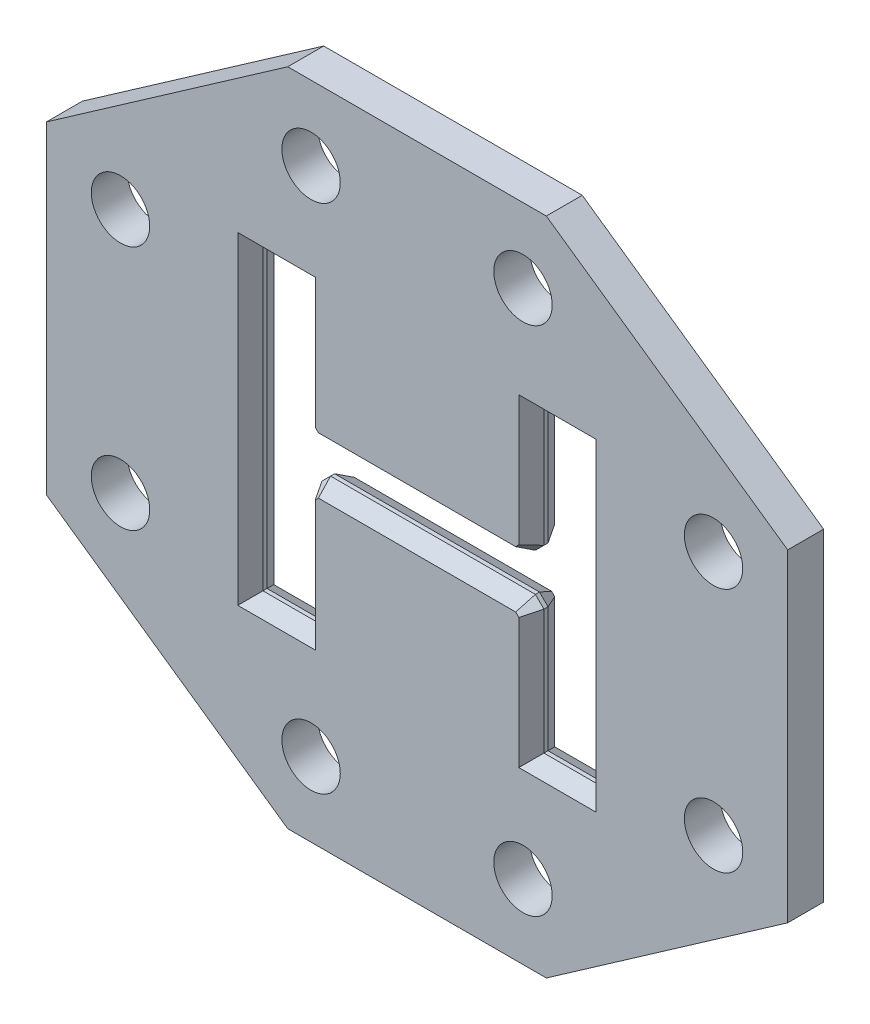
ISO-10303-21;
HEADER;
FILE_DESCRIPTION(('STEP AP214'),'2;1');
FILE_NAME('part.step','',(''),(''),'','','');
FILE_SCHEMA(('AUTOMOTIVE_DESIGN { 1 0 10303 214 1 1 1 1 }'));
ENDSEC;
DATA;
#1=APPLICATION_CONTEXT('core data for automotive mechanical design processes');
#2=APPLICATION_PROTOCOL_DEFINITION('international standard','automotive_design',2000,#1);
#3=PRODUCT_CONTEXT('',#1,'mechanical');
#4=PRODUCT('Part','Part','',(#3));
#5=PRODUCT_RELATED_PRODUCT_CATEGORY('part','',(#4));
#6=PRODUCT_DEFINITION_FORMATION('','',#4);
#7=PRODUCT_DEFINITION_CONTEXT('part definition',#1,'design');
#8=PRODUCT_DEFINITION('design','',#6,#7);
#9=PRODUCT_DEFINITION_SHAPE('','',#8);
#10=(LENGTH_UNIT() NAMED_UNIT(*) SI_UNIT(.MILLI.,.METRE.));
#11=(NAMED_UNIT(*) PLANE_ANGLE_UNIT() SI_UNIT($,.RADIAN.));
#12=(NAMED_UNIT(*) SI_UNIT($,.STERADIAN.) SOLID_ANGLE_UNIT());
#13=UNCERTAINTY_MEASURE_WITH_UNIT(LENGTH_MEASURE(1.E-05),#10,'distance_accuracy_value','');
#14=(GEOMETRIC_REPRESENTATION_CONTEXT(3) GLOBAL_UNCERTAINTY_ASSIGNED_CONTEXT((#13)) GLOBAL_UNIT_ASSIGNED_CONTEXT((#10,
#11,#12)) REPRESENTATION_CONTEXT('',''));
#15=CARTESIAN_POINT('',(0.,0.,0.));
#16=DIRECTION('',(0.,0.,1.));
#17=DIRECTION('',(1.,0.,0.));
#18=AXIS2_PLACEMENT_3D('',#15,#16,#17);
#19=CARTESIAN_POINT('',(156.845,-230.378,25.4));
#20=DIRECTION('',(1.,0.,0.));
#21=DIRECTION('',(0.,0.,-1.));
#22=AXIS2_PLACEMENT_3D('',#19,#20,#21);
#23=PLANE('',#22);
#24=DIRECTION('',(0.,0.,-1.));
#25=VECTOR('',#24,1.);
#26=CARTESIAN_POINT('',(156.845,-215.2015,25.4));
#27=LINE('',#26,#25);
#28=CARTESIAN_POINT('',(156.845,-215.2015,2.88333950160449));
#29=VERTEX_POINT('',#28);
#30=CARTESIAN_POINT('',(156.845,-215.2015,-2.88333950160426));
#31=VERTEX_POINT('',#30);
#32=EDGE_CURVE('E710',#29,#31,#27,.T.);
#33=ORIENTED_EDGE('',*,*,#32,.T.);
#34=DIRECTION('',(0.,1.,0.));
#35=VECTOR('',#34,1.);
#36=CARTESIAN_POINT('',(156.845,-230.378,-2.88333950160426));
#37=LINE('',#36,#35);
#38=CARTESIAN_POINT('',(156.845,-39.0524999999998,-2.88333950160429));
#39=VERTEX_POINT('',#38);
#40=EDGE_CURVE('E58',#31,#39,#37,.T.);
#41=ORIENTED_EDGE('',*,*,#40,.T.);
#42=DIRECTION('',(0.,0.,-1.));
#43=VECTOR('',#42,1.);
#44=CARTESIAN_POINT('',(156.845,-39.0524999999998,25.4));
#45=LINE('',#44,#43);
#46=CARTESIAN_POINT('',(156.845,-39.0524999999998,2.88333950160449));
#47=VERTEX_POINT('',#46);
#48=EDGE_CURVE('E708',#47,#39,#45,.T.);
#49=ORIENTED_EDGE('',*,*,#48,.F.);
#50=DIRECTION('',(0.,-1.,0.));
#51=VECTOR('',#50,1.);
#52=CARTESIAN_POINT('',(156.845,-215.2015,2.88333950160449));
#53=LINE('',#52,#51);
#54=EDGE_CURVE('E439',#47,#29,#53,.T.);
#55=ORIENTED_EDGE('',*,*,#54,.T.);
#56=EDGE_LOOP('',(#33,#41,#49,#55));
#57=FACE_BOUND('',#56,.T.);
#58=ADVANCED_FACE('F47',(#57),#23,.T.);
#59=CARTESIAN_POINT('',(-156.845,230.378,25.4));
#60=DIRECTION('',(-1.,0.,0.));
#61=DIRECTION('',(0.,0.,1.));
#62=AXIS2_PLACEMENT_3D('',#59,#60,#61);
#63=PLANE('',#62);
#64=DIRECTION('',(0.,0.,-1.));
#65=VECTOR('',#64,1.);
#66=CARTESIAN_POINT('',(-156.845,215.2015,25.4));
#67=LINE('',#66,#65);
#68=CARTESIAN_POINT('',(-156.845,215.2015,2.88333950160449));
#69=VERTEX_POINT('',#68);
#70=CARTESIAN_POINT('',(-156.845,215.2015,-2.88333950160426));
#71=VERTEX_POINT('',#70);
#72=EDGE_CURVE('E740',#69,#71,#67,.T.);
#73=ORIENTED_EDGE('',*,*,#72,.T.);
#74=DIRECTION('',(0.,-1.,0.));
#75=VECTOR('',#74,1.);
#76=CARTESIAN_POINT('',(-156.845,230.378,-2.88333950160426));
#77=LINE('',#76,#75);
#78=CARTESIAN_POINT('',(-156.845,39.0525000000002,-2.88333950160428));
#79=VERTEX_POINT('',#78);
#80=EDGE_CURVE('E573',#71,#79,#77,.T.);
#81=ORIENTED_EDGE('',*,*,#80,.T.);
#82=DIRECTION('',(0.,0.,-1.));
#83=VECTOR('',#82,1.);
#84=CARTESIAN_POINT('',(-156.845,39.0525000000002,25.4));
#85=LINE('',#84,#83);
#86=CARTESIAN_POINT('',(-156.845,39.0525000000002,2.88333950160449));
#87=VERTEX_POINT('',#86);
#88=EDGE_CURVE('E743',#87,#79,#85,.T.);
#89=ORIENTED_EDGE('',*,*,#88,.F.);
#90=DIRECTION('',(0.,1.,0.));
#91=VECTOR('',#90,1.);
#92=CARTESIAN_POINT('',(-156.845,215.2015,2.88333950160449));
#93=LINE('',#92,#91);
#94=EDGE_CURVE('E418',#87,#69,#93,.T.);
#95=ORIENTED_EDGE('',*,*,#94,.T.);
#96=EDGE_LOOP('',(#73,#81,#89,#95));
#97=FACE_BOUND('',#96,.T.);
#98=ADVANCED_FACE('F839',(#97),#63,.T.);
#99=CARTESIAN_POINT('',(0.,0.,25.4));
#100=DIRECTION('',(0.,0.,-1.));
#101=DIRECTION('',(-1.,0.,0.));
#102=AXIS2_PLACEMENT_3D('',#99,#100,#101);
#103=PLANE('',#102);
#104=DIRECTION('',(0.,-1.,0.));
#105=VECTOR('',#104,1.);
#106=CARTESIAN_POINT('',(253.284,-215.2015,25.4));
#107=LINE('',#106,#105);
#108=CARTESIAN_POINT('',(253.284,228.2015,25.4));
#109=VERTEX_POINT('',#108);
#110=CARTESIAN_POINT('',(253.284,-228.2015,25.4));
#111=VERTEX_POINT('',#110);
#112=EDGE_CURVE('E391',#109,#111,#107,.T.);
#113=ORIENTED_EDGE('',*,*,#112,.T.);
#114=DIRECTION('',(-1.,0.,0.));
#115=VECTOR('',#114,1.);
#116=CARTESIAN_POINT('',(156.845,-228.2015,25.4));
#117=LINE('',#116,#115);
#118=CARTESIAN_POINT('',(143.845,-228.2015,25.4));
#119=VERTEX_POINT('',#118);
#120=EDGE_CURVE('E392',#111,#119,#117,.T.);
#121=ORIENTED_EDGE('',*,*,#120,.T.);
#122=DIRECTION('',(0.,1.,0.));
#123=VECTOR('',#122,1.);
#124=CARTESIAN_POINT('',(143.845,-39.0524999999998,25.4));
#125=LINE('',#124,#123);
#126=CARTESIAN_POINT('',(143.845,-44.4372763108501,25.4));
#127=VERTEX_POINT('',#126);
#128=EDGE_CURVE('E344',#119,#127,#125,.T.);
#129=ORIENTED_EDGE('',*,*,#128,.T.);
#130=DIRECTION('',(-0.707106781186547,0.707106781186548,0.));
#131=VECTOR('',#130,1.);
#132=CARTESIAN_POINT('',(135.587611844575,-36.179888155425,25.4));
#133=LINE('',#132,#131);
#134=CARTESIAN_POINT('',(139.39522368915,-39.9875,25.4));
#135=VERTEX_POINT('',#134);
#136=EDGE_CURVE('E354',#127,#135,#133,.T.);
#137=ORIENTED_EDGE('',*,*,#136,.T.);
#138=DIRECTION('',(-1.,0.,0.));
#139=VECTOR('',#138,1.);
#140=CARTESIAN_POINT('',(-144.78,-39.9874999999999,25.4));
#141=LINE('',#140,#139);
#142=CARTESIAN_POINT('',(-139.39522368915,-39.9874999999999,25.4));
#143=VERTEX_POINT('',#142);
#144=EDGE_CURVE('E351',#135,#143,#141,.T.);
#145=ORIENTED_EDGE('',*,*,#144,.T.);
#146=DIRECTION('',(-0.707106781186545,-0.70710678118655,0.));
#147=VECTOR('',#146,1.);
#148=CARTESIAN_POINT('',(-147.652611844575,-48.244888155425,25.4));
#149=LINE('',#148,#147);
#150=CARTESIAN_POINT('',(-143.845,-44.4372763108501,25.4));
#151=VERTEX_POINT('',#150);
#152=EDGE_CURVE('E356',#143,#151,#149,.T.);
#153=ORIENTED_EDGE('',*,*,#152,.T.);
#154=DIRECTION('',(0.,-1.,0.));
#155=VECTOR('',#154,1.);
#156=CARTESIAN_POINT('',(-143.845,-215.2015,25.4));
#157=LINE('',#156,#155);
#158=CARTESIAN_POINT('',(-143.845,-228.2015,25.4));
#159=VERTEX_POINT('',#158);
#160=EDGE_CURVE('E363',#151,#159,#157,.T.);
#161=ORIENTED_EDGE('',*,*,#160,.T.);
#162=DIRECTION('',(-1.,0.,0.));
#163=VECTOR('',#162,1.);
#164=CARTESIAN_POINT('',(-240.284,-228.2015,25.4));
#165=LINE('',#164,#163);
#166=CARTESIAN_POINT('',(-253.284,-228.2015,25.4));
#167=VERTEX_POINT('',#166);
#168=EDGE_CURVE('E364',#159,#167,#165,.T.);
#169=ORIENTED_EDGE('',*,*,#168,.T.);
#170=DIRECTION('',(0.,1.,0.));
#171=VECTOR('',#170,1.);
#172=CARTESIAN_POINT('',(-253.284,215.2015,25.4));
#173=LINE('',#172,#171);
#174=CARTESIAN_POINT('',(-253.284,228.2015,25.4));
#175=VERTEX_POINT('',#174);
#176=EDGE_CURVE('E370',#167,#175,#173,.T.);
#177=ORIENTED_EDGE('',*,*,#176,.T.);
#178=DIRECTION('',(1.,0.,0.));
#179=VECTOR('',#178,1.);
#180=CARTESIAN_POINT('',(-156.845,228.2015,25.4));
#181=LINE('',#180,#179);
#182=CARTESIAN_POINT('',(-143.845,228.2015,25.4));
#183=VERTEX_POINT('',#182);
#184=EDGE_CURVE('E369',#175,#183,#181,.T.);
#185=ORIENTED_EDGE('',*,*,#184,.T.);
#186=DIRECTION('',(0.,-1.,0.));
#187=VECTOR('',#186,1.);
#188=CARTESIAN_POINT('',(-143.845,39.0525000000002,25.4));
#189=LINE('',#188,#187);
#190=CARTESIAN_POINT('',(-143.845,44.4372763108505,25.4));
#191=VERTEX_POINT('',#190);
#192=EDGE_CURVE('E373',#183,#191,#189,.T.);
#193=ORIENTED_EDGE('',*,*,#192,.T.);
#194=DIRECTION('',(0.707106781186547,-0.707106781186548,0.));
#195=VECTOR('',#194,1.);
#196=CARTESIAN_POINT('',(-135.587611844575,36.1798881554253,25.4));
#197=LINE('',#196,#195);
#198=CARTESIAN_POINT('',(-139.39522368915,39.9875000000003,25.4));
#199=VERTEX_POINT('',#198);
#200=EDGE_CURVE('E376',#191,#199,#197,.T.);
#201=ORIENTED_EDGE('',*,*,#200,.T.);
#202=DIRECTION('',(1.,0.,0.));
#203=VECTOR('',#202,1.);
#204=CARTESIAN_POINT('',(144.78,39.9875000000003,25.4));
#205=LINE('',#204,#203);
#206=CARTESIAN_POINT('',(139.39522368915,39.9875000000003,25.4));
#207=VERTEX_POINT('',#206);
#208=EDGE_CURVE('E378',#199,#207,#205,.T.);
#209=ORIENTED_EDGE('',*,*,#208,.T.);
#210=DIRECTION('',(0.707106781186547,0.707106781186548,0.));
#211=VECTOR('',#210,1.);
#212=CARTESIAN_POINT('',(147.652611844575,48.2448881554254,25.4));
#213=LINE('',#212,#211);
#214=CARTESIAN_POINT('',(143.845,44.4372763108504,25.4));
#215=VERTEX_POINT('',#214);
#216=EDGE_CURVE('E385',#207,#215,#213,.T.);
#217=ORIENTED_EDGE('',*,*,#216,.T.);
#218=DIRECTION('',(0.,1.,0.));
#219=VECTOR('',#218,1.);
#220=CARTESIAN_POINT('',(143.845,215.2015,25.4));
#221=LINE('',#220,#219);
#222=CARTESIAN_POINT('',(143.845,228.2015,25.4));
#223=VERTEX_POINT('',#222);
#224=EDGE_CURVE('E383',#215,#223,#221,.T.);
#225=ORIENTED_EDGE('',*,*,#224,.T.);
#226=DIRECTION('',(1.,0.,0.));
#227=VECTOR('',#226,1.);
#228=CARTESIAN_POINT('',(240.284,228.2015,25.4));
#229=LINE('',#228,#227);
#230=EDGE_CURVE('E386',#223,#109,#229,.T.);
#231=ORIENTED_EDGE('',*,*,#230,.T.);
#232=EDGE_LOOP('',(#113,#121,#129,#137,#145,#153,#161,#169,#177,#185,#193,#201,#209,#217,#225,#231));
#233=FACE_BOUND('',#232,.T.);
#234=CARTESIAN_POINT('',(-149.758610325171,-361.549268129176,25.4));
#235=DIRECTION('',(0.,0.,1.));
#236=DIRECTION('',(1.,0.,0.));
#237=AXIS2_PLACEMENT_3D('',#234,#235,#236);
#238=CIRCLE('',#237,41.275);
#239=CARTESIAN_POINT('',(-108.483610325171,-361.549268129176,25.4));
#240=VERTEX_POINT('',#239);
#241=EDGE_CURVE('E1673',#240,#240,#238,.T.);
#242=ORIENTED_EDGE('',*,*,#241,.F.);
#243=EDGE_LOOP('',(#242));
#244=FACE_BOUND('',#243,.T.);
#245=CARTESIAN_POINT('',(149.758610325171,-361.549268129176,25.4));
#246=DIRECTION('',(0.,0.,1.));
#247=DIRECTION('',(1.,0.,0.));
#248=AXIS2_PLACEMENT_3D('',#245,#246,#247);
#249=CIRCLE('',#248,41.275);
#250=CARTESIAN_POINT('',(191.033610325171,-361.549268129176,25.4));
#251=VERTEX_POINT('',#250);
#252=EDGE_CURVE('E1680',#251,#251,#249,.T.);
#253=ORIENTED_EDGE('',*,*,#252,.F.);
#254=EDGE_LOOP('',(#253));
#255=FACE_BOUND('',#254,.T.);
#256=CARTESIAN_POINT('',(419.080268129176,-173.588730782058,25.4));
#257=DIRECTION('',(0.,0.,1.));
#258=DIRECTION('',(1.,0.,0.));
#259=AXIS2_PLACEMENT_3D('',#256,#257,#258);
#260=CIRCLE('',#259,41.275);
#261=CARTESIAN_POINT('',(460.355268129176,-173.588730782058,25.4));
#262=VERTEX_POINT('',#261);
#263=EDGE_CURVE('E1682',#262,#262,#260,.T.);
#264=ORIENTED_EDGE('',*,*,#263,.F.);
#265=EDGE_LOOP('',(#264));
#266=FACE_BOUND('',#265,.T.);
#267=CARTESIAN_POINT('',(419.080268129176,173.588730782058,25.4));
#268=DIRECTION('',(0.,0.,1.));
#269=DIRECTION('',(1.,0.,0.));
#270=AXIS2_PLACEMENT_3D('',#267,#268,#269);
#271=CIRCLE('',#270,41.275);
#272=CARTESIAN_POINT('',(460.355268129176,173.588730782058,25.4));
#273=VERTEX_POINT('',#272);
#274=EDGE_CURVE('E1683',#273,#273,#271,.T.);
#275=ORIENTED_EDGE('',*,*,#274,.F.);
#276=EDGE_LOOP('',(#275));
#277=FACE_BOUND('',#276,.T.);
#278=CARTESIAN_POINT('',(149.758610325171,361.549268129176,25.4));
#279=DIRECTION('',(0.,0.,1.));
#280=DIRECTION('',(1.,0.,0.));
#281=AXIS2_PLACEMENT_3D('',#278,#279,#280);
#282=CIRCLE('',#281,41.275);
#283=CARTESIAN_POINT('',(191.033610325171,361.549268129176,25.4));
#284=VERTEX_POINT('',#283);
#285=EDGE_CURVE('E1689',#284,#284,#282,.T.);
#286=ORIENTED_EDGE('',*,*,#285,.F.);
#287=EDGE_LOOP('',(#286));
#288=FACE_BOUND('',#287,.T.);
#289=CARTESIAN_POINT('',(-149.758610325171,361.549268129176,25.4));
#290=DIRECTION('',(0.,0.,1.));
#291=DIRECTION('',(1.,0.,0.));
#292=AXIS2_PLACEMENT_3D('',#289,#290,#291);
#293=CIRCLE('',#292,41.275);
#294=CARTESIAN_POINT('',(-108.483610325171,361.549268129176,25.4));
#295=VERTEX_POINT('',#294);
#296=EDGE_CURVE('E1693',#295,#295,#293,.T.);
#297=ORIENTED_EDGE('',*,*,#296,.F.);
#298=EDGE_LOOP('',(#297));
#299=FACE_BOUND('',#298,.T.);
#300=CARTESIAN_POINT('',(-419.080268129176,173.588730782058,25.4));
#301=DIRECTION('',(0.,0.,1.));
#302=DIRECTION('',(1.,0.,0.));
#303=AXIS2_PLACEMENT_3D('',#300,#301,#302);
#304=CIRCLE('',#303,41.275);
#305=CARTESIAN_POINT('',(-377.805268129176,173.588730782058,25.4));
#306=VERTEX_POINT('',#305);
#307=EDGE_CURVE('E1699',#306,#306,#304,.T.);
#308=ORIENTED_EDGE('',*,*,#307,.F.);
#309=EDGE_LOOP('',(#308));
#310=FACE_BOUND('',#309,.T.);
#311=CARTESIAN_POINT('',(-419.080268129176,-173.588730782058,25.4));
#312=DIRECTION('',(0.,0.,1.));
#313=DIRECTION('',(1.,0.,0.));
#314=AXIS2_PLACEMENT_3D('',#311,#312,#313);
#315=CIRCLE('',#314,41.275);
#316=CARTESIAN_POINT('',(-377.805268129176,-173.588730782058,25.4));
#317=VERTEX_POINT('',#316);
#318=EDGE_CURVE('E693',#317,#317,#315,.T.);
#319=ORIENTED_EDGE('',*,*,#318,.F.);
#320=EDGE_LOOP('',(#319));
#321=FACE_BOUND('',#320,.T.);
#322=DIRECTION('',(0.,-1.,0.));
#323=VECTOR('',#322,1.);
#324=CARTESIAN_POINT('',(-523.855268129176,-228.234235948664,25.4));
#325=LINE('',#324,#323);
#326=CARTESIAN_POINT('',(-523.855268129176,228.234235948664,25.4));
#327=VERTEX_POINT('',#326);
#328=CARTESIAN_POINT('',(-523.855268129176,-228.234235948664,25.4));
#329=VERTEX_POINT('',#328);
#330=EDGE_CURVE('E321',#327,#329,#325,.T.);
#331=ORIENTED_EDGE('',*,*,#330,.T.);
#332=DIRECTION('',(0.820038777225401,-0.572307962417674,0.));
#333=VECTOR('',#332,1.);
#334=CARTESIAN_POINT('',(-182.70492307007,-466.324268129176,25.4));
#335=LINE('',#334,#333);
#336=CARTESIAN_POINT('',(-182.70492307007,-466.324268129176,25.4));
#337=VERTEX_POINT('',#336);
#338=EDGE_CURVE('E311',#329,#337,#335,.T.);
#339=ORIENTED_EDGE('',*,*,#338,.T.);
#340=DIRECTION('',(1.,0.,0.));
#341=VECTOR('',#340,1.);
#342=CARTESIAN_POINT('',(182.70492307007,-466.324268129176,25.4));
#343=LINE('',#342,#341);
#344=CARTESIAN_POINT('',(182.70492307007,-466.324268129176,25.4));
#345=VERTEX_POINT('',#344);
#346=EDGE_CURVE('E325',#337,#345,#343,.T.);
#347=ORIENTED_EDGE('',*,*,#346,.T.);
#348=DIRECTION('',(0.820038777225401,0.572307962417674,0.));
#349=VECTOR('',#348,1.);
#350=CARTESIAN_POINT('',(523.855268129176,-228.234235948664,25.4));
#351=LINE('',#350,#349);
#352=CARTESIAN_POINT('',(523.855268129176,-228.234235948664,25.4));
#353=VERTEX_POINT('',#352);
#354=EDGE_CURVE('E750',#345,#353,#351,.T.);
#355=ORIENTED_EDGE('',*,*,#354,.T.);
#356=DIRECTION('',(0.,1.,0.));
#357=VECTOR('',#356,1.);
#358=CARTESIAN_POINT('',(523.855268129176,228.234235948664,25.4));
#359=LINE('',#358,#357);
#360=CARTESIAN_POINT('',(523.855268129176,228.234235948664,25.4));
#361=VERTEX_POINT('',#360);
#362=EDGE_CURVE('E755',#353,#361,#359,.T.);
#363=ORIENTED_EDGE('',*,*,#362,.T.);
#364=DIRECTION('',(-0.820038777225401,0.572307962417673,0.));
#365=VECTOR('',#364,1.);
#366=CARTESIAN_POINT('',(182.70492307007,466.324268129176,25.4));
#367=LINE('',#366,#365);
#368=CARTESIAN_POINT('',(182.70492307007,466.324268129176,25.4));
#369=VERTEX_POINT('',#368);
#370=EDGE_CURVE('E752',#361,#369,#367,.T.);
#371=ORIENTED_EDGE('',*,*,#370,.T.);
#372=DIRECTION('',(-1.,0.,0.));
#373=VECTOR('',#372,1.);
#374=CARTESIAN_POINT('',(-182.704923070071,466.324268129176,25.4));
#375=LINE('',#374,#373);
#376=CARTESIAN_POINT('',(-182.704923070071,466.324268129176,25.4));
#377=VERTEX_POINT('',#376);
#378=EDGE_CURVE('E758',#369,#377,#375,.T.);
#379=ORIENTED_EDGE('',*,*,#378,.T.);
#380=DIRECTION('',(-0.8200387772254,-0.572307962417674,0.));
#381=VECTOR('',#380,1.);
#382=CARTESIAN_POINT('',(-523.855268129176,228.234235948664,25.4));
#383=LINE('',#382,#381);
#384=EDGE_CURVE('E328',#377,#327,#383,.T.);
#385=ORIENTED_EDGE('',*,*,#384,.T.);
#386=EDGE_LOOP('',(#331,#339,#347,#355,#363,#371,#379,#385));
#387=FACE_BOUND('',#386,.T.);
#388=ADVANCED_FACE('F326',(#233,#244,#255,#266,#277,#288,#299,#310,#321,#387),#103,.F.);
#389=CARTESIAN_POINT('',(0.,0.,-25.4));
#390=DIRECTION('',(0.,0.,-1.));
#391=DIRECTION('',(-1.,0.,0.));
#392=AXIS2_PLACEMENT_3D('',#389,#390,#391);
#393=PLANE('',#392);
#394=DIRECTION('',(0.707106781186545,0.70710678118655,0.));
#395=VECTOR('',#394,1.);
#396=CARTESIAN_POINT('',(-49.7038618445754,49.703861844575,-25.4));
#397=LINE('',#396,#395);
#398=CARTESIAN_POINT('',(-143.845,-44.4372763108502,-25.4));
#399=VERTEX_POINT('',#398);
#400=CARTESIAN_POINT('',(-139.39522368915,-39.9875000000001,-25.4));
#401=VERTEX_POINT('',#400);
#402=EDGE_CURVE('E547',#399,#401,#397,.T.);
#403=ORIENTED_EDGE('',*,*,#402,.T.);
#404=DIRECTION('',(1.,0.,0.));
#405=VECTOR('',#404,1.);
#406=CARTESIAN_POINT('',(0.,-39.9875000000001,-25.4));
#407=LINE('',#406,#405);
#408=CARTESIAN_POINT('',(139.39522368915,-39.9875000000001,-25.4));
#409=VERTEX_POINT('',#408);
#410=EDGE_CURVE('E553',#401,#409,#407,.T.);
#411=ORIENTED_EDGE('',*,*,#410,.T.);
#412=DIRECTION('',(0.707106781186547,-0.707106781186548,0.));
#413=VECTOR('',#412,1.);
#414=CARTESIAN_POINT('',(49.703861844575,49.7038618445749,-25.4));
#415=LINE('',#414,#413);
#416=CARTESIAN_POINT('',(143.845,-44.4372763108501,-25.4));
#417=VERTEX_POINT('',#416);
#418=EDGE_CURVE('E442',#409,#417,#415,.T.);
#419=ORIENTED_EDGE('',*,*,#418,.T.);
#420=DIRECTION('',(0.,-1.,0.));
#421=VECTOR('',#420,1.);
#422=CARTESIAN_POINT('',(143.845,0.,-25.4));
#423=LINE('',#422,#421);
#424=CARTESIAN_POINT('',(143.845,-228.2015,-25.4));
#425=VERTEX_POINT('',#424);
#426=EDGE_CURVE('E508',#417,#425,#423,.T.);
#427=ORIENTED_EDGE('',*,*,#426,.T.);
#428=DIRECTION('',(1.,0.,0.));
#429=VECTOR('',#428,1.);
#430=CARTESIAN_POINT('',(0.,-228.2015,-25.4));
#431=LINE('',#430,#429);
#432=CARTESIAN_POINT('',(253.284,-228.2015,-25.4));
#433=VERTEX_POINT('',#432);
#434=EDGE_CURVE('E515',#425,#433,#431,.T.);
#435=ORIENTED_EDGE('',*,*,#434,.T.);
#436=DIRECTION('',(0.,1.,0.));
#437=VECTOR('',#436,1.);
#438=CARTESIAN_POINT('',(253.284,0.,-25.4));
#439=LINE('',#438,#437);
#440=CARTESIAN_POINT('',(253.284,228.2015,-25.4));
#441=VERTEX_POINT('',#440);
#442=EDGE_CURVE('E513',#433,#441,#439,.T.);
#443=ORIENTED_EDGE('',*,*,#442,.T.);
#444=DIRECTION('',(-1.,0.,0.));
#445=VECTOR('',#444,1.);
#446=CARTESIAN_POINT('',(1.51820227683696E-13,228.201500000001,-25.4));
#447=LINE('',#446,#445);
#448=CARTESIAN_POINT('',(143.845,228.2015,-25.4));
#449=VERTEX_POINT('',#448);
#450=EDGE_CURVE('E516',#441,#449,#447,.T.);
#451=ORIENTED_EDGE('',*,*,#450,.T.);
#452=DIRECTION('',(0.,-1.,0.));
#453=VECTOR('',#452,1.);
#454=CARTESIAN_POINT('',(143.845,0.,-25.4));
#455=LINE('',#454,#453);
#456=CARTESIAN_POINT('',(143.845,44.4372763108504,-25.4));
#457=VERTEX_POINT('',#456);
#458=EDGE_CURVE('E521',#449,#457,#455,.T.);
#459=ORIENTED_EDGE('',*,*,#458,.T.);
#460=DIRECTION('',(-0.707106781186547,-0.707106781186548,0.));
#461=VECTOR('',#460,1.);
#462=CARTESIAN_POINT('',(49.7038618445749,-49.7038618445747,-25.4));
#463=LINE('',#462,#461);
#464=CARTESIAN_POINT('',(139.39522368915,39.9875000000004,-25.4));
#465=VERTEX_POINT('',#464);
#466=EDGE_CURVE('E522',#457,#465,#463,.T.);
#467=ORIENTED_EDGE('',*,*,#466,.T.);
#468=DIRECTION('',(-1.,0.,0.));
#469=VECTOR('',#468,1.);
#470=CARTESIAN_POINT('',(0.,39.9875000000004,-25.4));
#471=LINE('',#470,#469);
#472=CARTESIAN_POINT('',(-139.39522368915,39.9875000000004,-25.4));
#473=VERTEX_POINT('',#472);
#474=EDGE_CURVE('E529',#465,#473,#471,.T.);
#475=ORIENTED_EDGE('',*,*,#474,.T.);
#476=DIRECTION('',(-0.707106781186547,0.707106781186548,0.));
#477=VECTOR('',#476,1.);
#478=CARTESIAN_POINT('',(-49.7038618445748,-49.7038618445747,-25.4));
#479=LINE('',#478,#477);
#480=CARTESIAN_POINT('',(-143.845,44.4372763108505,-25.4));
#481=VERTEX_POINT('',#480);
#482=EDGE_CURVE('E526',#473,#481,#479,.T.);
#483=ORIENTED_EDGE('',*,*,#482,.T.);
#484=DIRECTION('',(0.,1.,0.));
#485=VECTOR('',#484,1.);
#486=CARTESIAN_POINT('',(-143.845,0.,-25.4));
#487=LINE('',#486,#485);
#488=CARTESIAN_POINT('',(-143.845,228.2015,-25.4));
#489=VERTEX_POINT('',#488);
#490=EDGE_CURVE('E531',#481,#489,#487,.T.);
#491=ORIENTED_EDGE('',*,*,#490,.T.);
#492=DIRECTION('',(-1.,0.,0.));
#493=VECTOR('',#492,1.);
#494=CARTESIAN_POINT('',(0.,228.2015,-25.4));
#495=LINE('',#494,#493);
#496=CARTESIAN_POINT('',(-253.284,228.2015,-25.4));
#497=VERTEX_POINT('',#496);
#498=EDGE_CURVE('E538',#489,#497,#495,.T.);
#499=ORIENTED_EDGE('',*,*,#498,.T.);
#500=DIRECTION('',(0.,-1.,0.));
#501=VECTOR('',#500,1.);
#502=CARTESIAN_POINT('',(-253.284,0.,-25.4));
#503=LINE('',#502,#501);
#504=CARTESIAN_POINT('',(-253.284,-228.2015,-25.4));
#505=VERTEX_POINT('',#504);
#506=EDGE_CURVE('E539',#497,#505,#503,.T.);
#507=ORIENTED_EDGE('',*,*,#506,.T.);
#508=DIRECTION('',(1.,0.,0.));
#509=VECTOR('',#508,1.);
#510=CARTESIAN_POINT('',(0.,-228.2015,-25.4));
#511=LINE('',#510,#509);
#512=CARTESIAN_POINT('',(-143.845,-228.2015,-25.4));
#513=VERTEX_POINT('',#512);
#514=EDGE_CURVE('E545',#505,#513,#511,.T.);
#515=ORIENTED_EDGE('',*,*,#514,.T.);
#516=DIRECTION('',(0.,1.,0.));
#517=VECTOR('',#516,1.);
#518=CARTESIAN_POINT('',(-143.845,0.,-25.4));
#519=LINE('',#518,#517);
#520=EDGE_CURVE('E544',#513,#399,#519,.T.);
#521=ORIENTED_EDGE('',*,*,#520,.T.);
#522=EDGE_LOOP('',(#403,#411,#419,#427,#435,#443,#451,#459,#467,#475,#483,#491,#499,#507,#515,#521));
#523=FACE_BOUND('',#522,.T.);
#524=CARTESIAN_POINT('',(-149.758610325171,-361.549268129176,-25.4));
#525=DIRECTION('',(0.,0.,1.));
#526=DIRECTION('',(1.,0.,0.));
#527=AXIS2_PLACEMENT_3D('',#524,#525,#526);
#528=CIRCLE('',#527,41.275);
#529=CARTESIAN_POINT('',(-108.483610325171,-361.549268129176,-25.4));
#530=VERTEX_POINT('',#529);
#531=EDGE_CURVE('E506',#530,#530,#528,.T.);
#532=ORIENTED_EDGE('',*,*,#531,.T.);
#533=EDGE_LOOP('',(#532));
#534=FACE_BOUND('',#533,.T.);
#535=CARTESIAN_POINT('',(149.758610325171,-361.549268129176,-25.4));
#536=DIRECTION('',(0.,0.,1.));
#537=DIRECTION('',(1.,0.,0.));
#538=AXIS2_PLACEMENT_3D('',#535,#536,#537);
#539=CIRCLE('',#538,41.275);
#540=CARTESIAN_POINT('',(191.033610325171,-361.549268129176,-25.4));
#541=VERTEX_POINT('',#540);
#542=EDGE_CURVE('E1706',#541,#541,#539,.T.);
#543=ORIENTED_EDGE('',*,*,#542,.T.);
#544=EDGE_LOOP('',(#543));
#545=FACE_BOUND('',#544,.T.);
#546=CARTESIAN_POINT('',(419.080268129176,-173.588730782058,-25.4));
#547=DIRECTION('',(0.,0.,1.));
#548=DIRECTION('',(1.,0.,0.));
#549=AXIS2_PLACEMENT_3D('',#546,#547,#548);
#550=CIRCLE('',#549,41.275);
#551=CARTESIAN_POINT('',(460.355268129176,-173.588730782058,-25.4));
#552=VERTEX_POINT('',#551);
#553=EDGE_CURVE('E1712',#552,#552,#550,.T.);
#554=ORIENTED_EDGE('',*,*,#553,.T.);
#555=EDGE_LOOP('',(#554));
#556=FACE_BOUND('',#555,.T.);
#557=CARTESIAN_POINT('',(419.080268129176,173.588730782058,-25.4));
#558=DIRECTION('',(0.,0.,1.));
#559=DIRECTION('',(1.,0.,0.));
#560=AXIS2_PLACEMENT_3D('',#557,#558,#559);
#561=CIRCLE('',#560,41.275);
#562=CARTESIAN_POINT('',(460.355268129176,173.588730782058,-25.4));
#563=VERTEX_POINT('',#562);
#564=EDGE_CURVE('E1716',#563,#563,#561,.T.);
#565=ORIENTED_EDGE('',*,*,#564,.T.);
#566=EDGE_LOOP('',(#565));
#567=FACE_BOUND('',#566,.T.);
#568=CARTESIAN_POINT('',(149.758610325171,361.549268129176,-25.4));
#569=DIRECTION('',(0.,0.,1.));
#570=DIRECTION('',(1.,0.,0.));
#571=AXIS2_PLACEMENT_3D('',#568,#569,#570);
#572=CIRCLE('',#571,41.275);
#573=CARTESIAN_POINT('',(191.033610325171,361.549268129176,-25.4));
#574=VERTEX_POINT('',#573);
#575=EDGE_CURVE('E1728',#574,#574,#572,.T.);
#576=ORIENTED_EDGE('',*,*,#575,.T.);
#577=EDGE_LOOP('',(#576));
#578=FACE_BOUND('',#577,.T.);
#579=CARTESIAN_POINT('',(-149.758610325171,361.549268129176,-25.4));
#580=DIRECTION('',(0.,0.,1.));
#581=DIRECTION('',(1.,0.,0.));
#582=AXIS2_PLACEMENT_3D('',#579,#580,#581);
#583=CIRCLE('',#582,41.275);
#584=CARTESIAN_POINT('',(-108.483610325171,361.549268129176,-25.4));
#585=VERTEX_POINT('',#584);
#586=EDGE_CURVE('E1735',#585,#585,#583,.T.);
#587=ORIENTED_EDGE('',*,*,#586,.T.);
#588=EDGE_LOOP('',(#587));
#589=FACE_BOUND('',#588,.T.);
#590=CARTESIAN_POINT('',(-419.080268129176,173.588730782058,-25.4));
#591=DIRECTION('',(0.,0.,1.));
#592=DIRECTION('',(1.,0.,0.));
#593=AXIS2_PLACEMENT_3D('',#590,#591,#592);
#594=CIRCLE('',#593,41.275);
#595=CARTESIAN_POINT('',(-377.805268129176,173.588730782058,-25.4));
#596=VERTEX_POINT('',#595);
#597=EDGE_CURVE('E1701',#596,#596,#594,.T.);
#598=ORIENTED_EDGE('',*,*,#597,.T.);
#599=EDGE_LOOP('',(#598));
#600=FACE_BOUND('',#599,.T.);
#601=CARTESIAN_POINT('',(-419.080268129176,-173.588730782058,-25.4));
#602=DIRECTION('',(0.,0.,1.));
#603=DIRECTION('',(1.,0.,0.));
#604=AXIS2_PLACEMENT_3D('',#601,#602,#603);
#605=CIRCLE('',#604,41.275);
#606=CARTESIAN_POINT('',(-377.805268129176,-173.588730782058,-25.4));
#607=VERTEX_POINT('',#606);
#608=EDGE_CURVE('E688',#607,#607,#605,.T.);
#609=ORIENTED_EDGE('',*,*,#608,.T.);
#610=EDGE_LOOP('',(#609));
#611=FACE_BOUND('',#610,.T.);
#612=DIRECTION('',(0.,-1.,0.));
#613=VECTOR('',#612,1.);
#614=CARTESIAN_POINT('',(-523.855268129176,-228.234235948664,-25.4));
#615=LINE('',#614,#613);
#616=CARTESIAN_POINT('',(-523.855268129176,228.234235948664,-25.4));
#617=VERTEX_POINT('',#616);
#618=CARTESIAN_POINT('',(-523.855268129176,-228.234235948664,-25.4));
#619=VERTEX_POINT('',#618);
#620=EDGE_CURVE('E340',#617,#619,#615,.T.);
#621=ORIENTED_EDGE('',*,*,#620,.F.);
#622=DIRECTION('',(-0.8200387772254,-0.572307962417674,0.));
#623=VECTOR('',#622,1.);
#624=CARTESIAN_POINT('',(-523.855268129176,228.234235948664,-25.4));
#625=LINE('',#624,#623);
#626=CARTESIAN_POINT('',(-182.704923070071,466.324268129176,-25.4));
#627=VERTEX_POINT('',#626);
#628=EDGE_CURVE('E332',#627,#617,#625,.T.);
#629=ORIENTED_EDGE('',*,*,#628,.F.);
#630=DIRECTION('',(-1.,0.,0.));
#631=VECTOR('',#630,1.);
#632=CARTESIAN_POINT('',(-182.704923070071,466.324268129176,-25.4));
#633=LINE('',#632,#631);
#634=CARTESIAN_POINT('',(182.70492307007,466.324268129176,-25.4));
#635=VERTEX_POINT('',#634);
#636=EDGE_CURVE('E781',#635,#627,#633,.T.);
#637=ORIENTED_EDGE('',*,*,#636,.F.);
#638=DIRECTION('',(-0.820038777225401,0.572307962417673,0.));
#639=VECTOR('',#638,1.);
#640=CARTESIAN_POINT('',(182.70492307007,466.324268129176,-25.4));
#641=LINE('',#640,#639);
#642=CARTESIAN_POINT('',(523.855268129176,228.234235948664,-25.4));
#643=VERTEX_POINT('',#642);
#644=EDGE_CURVE('E776',#643,#635,#641,.T.);
#645=ORIENTED_EDGE('',*,*,#644,.F.);
#646=DIRECTION('',(0.,1.,0.));
#647=VECTOR('',#646,1.);
#648=CARTESIAN_POINT('',(523.855268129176,228.234235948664,-25.4));
#649=LINE('',#648,#647);
#650=CARTESIAN_POINT('',(523.855268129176,-228.234235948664,-25.4));
#651=VERTEX_POINT('',#650);
#652=EDGE_CURVE('E773',#651,#643,#649,.T.);
#653=ORIENTED_EDGE('',*,*,#652,.F.);
#654=DIRECTION('',(0.820038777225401,0.572307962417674,0.));
#655=VECTOR('',#654,1.);
#656=CARTESIAN_POINT('',(523.855268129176,-228.234235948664,-25.4));
#657=LINE('',#656,#655);
#658=CARTESIAN_POINT('',(182.70492307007,-466.324268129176,-25.4));
#659=VERTEX_POINT('',#658);
#660=EDGE_CURVE('E775',#659,#651,#657,.T.);
#661=ORIENTED_EDGE('',*,*,#660,.F.);
#662=DIRECTION('',(1.,0.,0.));
#663=VECTOR('',#662,1.);
#664=CARTESIAN_POINT('',(182.70492307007,-466.324268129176,-25.4));
#665=LINE('',#664,#663);
#666=CARTESIAN_POINT('',(-182.70492307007,-466.324268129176,-25.4));
#667=VERTEX_POINT('',#666);
#668=EDGE_CURVE('E768',#667,#659,#665,.T.);
#669=ORIENTED_EDGE('',*,*,#668,.F.);
#670=DIRECTION('',(0.820038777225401,-0.572307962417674,0.));
#671=VECTOR('',#670,1.);
#672=CARTESIAN_POINT('',(-182.70492307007,-466.324268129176,-25.4));
#673=LINE('',#672,#671);
#674=EDGE_CURVE('E766',#619,#667,#673,.T.);
#675=ORIENTED_EDGE('',*,*,#674,.F.);
#676=EDGE_LOOP('',(#621,#629,#637,#645,#653,#661,#669,#675));
#677=FACE_BOUND('',#676,.T.);
#678=ADVANCED_FACE('F814',(#523,#534,#545,#556,#567,#578,#589,#600,#611,#677),#393,.T.);
#679=CARTESIAN_POINT('',(-523.855268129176,-228.234235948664,25.4));
#680=DIRECTION('',(1.,0.,0.));
#681=DIRECTION('',(0.,0.,-1.));
#682=AXIS2_PLACEMENT_3D('',#679,#680,#681);
#683=PLANE('',#682);
#684=ORIENTED_EDGE('',*,*,#620,.T.);
#685=DIRECTION('',(0.,0.,-1.));
#686=VECTOR('',#685,1.);
#687=CARTESIAN_POINT('',(-523.855268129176,-228.234235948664,25.4));
#688=LINE('',#687,#686);
#689=EDGE_CURVE('E314',#329,#619,#688,.T.);
#690=ORIENTED_EDGE('',*,*,#689,.F.);
#691=ORIENTED_EDGE('',*,*,#330,.F.);
#692=DIRECTION('',(0.,0.,-1.));
#693=VECTOR('',#692,1.);
#694=CARTESIAN_POINT('',(-523.855268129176,228.234235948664,25.4));
#695=LINE('',#694,#693);
#696=EDGE_CURVE('E763',#327,#617,#695,.T.);
#697=ORIENTED_EDGE('',*,*,#696,.T.);
#698=EDGE_LOOP('',(#684,#690,#691,#697));
#699=FACE_BOUND('',#698,.T.);
#700=ADVANCED_FACE('F331',(#699),#683,.F.);
#701=CARTESIAN_POINT('',(-182.70492307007,-466.324268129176,25.4));
#702=DIRECTION('',(0.572307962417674,0.820038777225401,0.));
#703=DIRECTION('',(-0.820038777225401,0.572307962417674,0.));
#704=AXIS2_PLACEMENT_3D('',#701,#702,#703);
#705=PLANE('',#704);
#706=ORIENTED_EDGE('',*,*,#674,.T.);
#707=DIRECTION('',(0.,0.,-1.));
#708=VECTOR('',#707,1.);
#709=CARTESIAN_POINT('',(-182.70492307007,-466.324268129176,25.4));
#710=LINE('',#709,#708);
#711=EDGE_CURVE('E319',#337,#667,#710,.T.);
#712=ORIENTED_EDGE('',*,*,#711,.F.);
#713=ORIENTED_EDGE('',*,*,#338,.F.);
#714=ORIENTED_EDGE('',*,*,#689,.T.);
#715=EDGE_LOOP('',(#706,#712,#713,#714));
#716=FACE_BOUND('',#715,.T.);
#717=ADVANCED_FACE('F312',(#716),#705,.F.);
#718=CARTESIAN_POINT('',(182.70492307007,-466.324268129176,25.4));
#719=DIRECTION('',(0.,1.,0.));
#720=DIRECTION('',(0.,0.,1.));
#721=AXIS2_PLACEMENT_3D('',#718,#719,#720);
#722=PLANE('',#721);
#723=ORIENTED_EDGE('',*,*,#668,.T.);
#724=DIRECTION('',(0.,0.,-1.));
#725=VECTOR('',#724,1.);
#726=CARTESIAN_POINT('',(182.70492307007,-466.324268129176,25.4));
#727=LINE('',#726,#725);
#728=EDGE_CURVE('E346',#345,#659,#727,.T.);
#729=ORIENTED_EDGE('',*,*,#728,.F.);
#730=ORIENTED_EDGE('',*,*,#346,.F.);
#731=ORIENTED_EDGE('',*,*,#711,.T.);
#732=EDGE_LOOP('',(#723,#729,#730,#731));
#733=FACE_BOUND('',#732,.T.);
#734=ADVANCED_FACE('F828',(#733),#722,.F.);
#735=CARTESIAN_POINT('',(523.855268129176,-228.234235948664,25.4));
#736=DIRECTION('',(-0.572307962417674,0.820038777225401,0.));
#737=DIRECTION('',(-0.820038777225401,-0.572307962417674,0.));
#738=AXIS2_PLACEMENT_3D('',#735,#736,#737);
#739=PLANE('',#738);
#740=ORIENTED_EDGE('',*,*,#660,.T.);
#741=DIRECTION('',(0.,0.,-1.));
#742=VECTOR('',#741,1.);
#743=CARTESIAN_POINT('',(523.855268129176,-228.234235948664,25.4));
#744=LINE('',#743,#742);
#745=EDGE_CURVE('E797',#353,#651,#744,.T.);
#746=ORIENTED_EDGE('',*,*,#745,.F.);
#747=ORIENTED_EDGE('',*,*,#354,.F.);
#748=ORIENTED_EDGE('',*,*,#728,.T.);
#749=EDGE_LOOP('',(#740,#746,#747,#748));
#750=FACE_BOUND('',#749,.T.);
#751=ADVANCED_FACE('F810',(#750),#739,.F.);
#752=CARTESIAN_POINT('',(523.855268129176,228.234235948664,25.4));
#753=DIRECTION('',(-1.,0.,0.));
#754=DIRECTION('',(0.,-1.,0.));
#755=AXIS2_PLACEMENT_3D('',#752,#753,#754);
#756=PLANE('',#755);
#757=ORIENTED_EDGE('',*,*,#652,.T.);
#758=DIRECTION('',(0.,0.,-1.));
#759=VECTOR('',#758,1.);
#760=CARTESIAN_POINT('',(523.855268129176,228.234235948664,25.4));
#761=LINE('',#760,#759);
#762=EDGE_CURVE('E798',#361,#643,#761,.T.);
#763=ORIENTED_EDGE('',*,*,#762,.F.);
#764=ORIENTED_EDGE('',*,*,#362,.F.);
#765=ORIENTED_EDGE('',*,*,#745,.T.);
#766=EDGE_LOOP('',(#757,#763,#764,#765));
#767=FACE_BOUND('',#766,.T.);
#768=ADVANCED_FACE('F817',(#767),#756,.F.);
#769=CARTESIAN_POINT('',(182.70492307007,466.324268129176,25.4));
#770=DIRECTION('',(-0.572307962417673,-0.820038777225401,0.));
#771=DIRECTION('',(0.820038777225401,-0.572307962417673,0.));
#772=AXIS2_PLACEMENT_3D('',#769,#770,#771);
#773=PLANE('',#772);
#774=ORIENTED_EDGE('',*,*,#644,.T.);
#775=DIRECTION('',(0.,0.,-1.));
#776=VECTOR('',#775,1.);
#777=CARTESIAN_POINT('',(182.70492307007,466.324268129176,25.4));
#778=LINE('',#777,#776);
#779=EDGE_CURVE('E795',#369,#635,#778,.T.);
#780=ORIENTED_EDGE('',*,*,#779,.F.);
#781=ORIENTED_EDGE('',*,*,#370,.F.);
#782=ORIENTED_EDGE('',*,*,#762,.T.);
#783=EDGE_LOOP('',(#774,#780,#781,#782));
#784=FACE_BOUND('',#783,.T.);
#785=ADVANCED_FACE('F822',(#784),#773,.F.);
#786=CARTESIAN_POINT('',(-182.704923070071,466.324268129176,25.4));
#787=DIRECTION('',(0.,-1.,0.));
#788=DIRECTION('',(1.,0.,0.));
#789=AXIS2_PLACEMENT_3D('',#786,#787,#788);
#790=PLANE('',#789);
#791=ORIENTED_EDGE('',*,*,#636,.T.);
#792=DIRECTION('',(0.,0.,-1.));
#793=VECTOR('',#792,1.);
#794=CARTESIAN_POINT('',(-182.704923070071,466.324268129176,25.4));
#795=LINE('',#794,#793);
#796=EDGE_CURVE('E787',#377,#627,#795,.T.);
#797=ORIENTED_EDGE('',*,*,#796,.F.);
#798=ORIENTED_EDGE('',*,*,#378,.F.);
#799=ORIENTED_EDGE('',*,*,#779,.T.);
#800=EDGE_LOOP('',(#791,#797,#798,#799));
#801=FACE_BOUND('',#800,.T.);
#802=ADVANCED_FACE('F856',(#801),#790,.F.);
#803=CARTESIAN_POINT('',(-523.855268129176,228.234235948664,25.4));
#804=DIRECTION('',(0.572307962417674,-0.8200387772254,0.));
#805=DIRECTION('',(0.8200387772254,0.572307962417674,0.));
#806=AXIS2_PLACEMENT_3D('',#803,#804,#805);
#807=PLANE('',#806);
#808=ORIENTED_EDGE('',*,*,#628,.T.);
#809=ORIENTED_EDGE('',*,*,#696,.F.);
#810=ORIENTED_EDGE('',*,*,#384,.F.);
#811=ORIENTED_EDGE('',*,*,#796,.T.);
#812=EDGE_LOOP('',(#808,#809,#810,#811));
#813=FACE_BOUND('',#812,.T.);
#814=ADVANCED_FACE('F851',(#813),#807,.F.);
#815=CARTESIAN_POINT('',(156.845,54.2290000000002,25.4));
#816=DIRECTION('',(1.,0.,0.));
#817=DIRECTION('',(0.,0.,-1.));
#818=AXIS2_PLACEMENT_3D('',#815,#816,#817);
#819=PLANE('',#818);
#820=DIRECTION('',(0.,0.,-1.));
#821=VECTOR('',#820,1.);
#822=CARTESIAN_POINT('',(156.845,39.0525000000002,25.4));
#823=LINE('',#822,#821);
#824=CARTESIAN_POINT('',(156.845,39.0525000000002,2.88333950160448));
#825=VERTEX_POINT('',#824);
#826=CARTESIAN_POINT('',(156.845,39.0525000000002,-2.88333950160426));
#827=VERTEX_POINT('',#826);
#828=EDGE_CURVE('E684',#825,#827,#823,.T.);
#829=ORIENTED_EDGE('',*,*,#828,.T.);
#830=DIRECTION('',(0.,1.,0.));
#831=VECTOR('',#830,1.);
#832=CARTESIAN_POINT('',(156.845,54.2290000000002,-2.88333950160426));
#833=LINE('',#832,#831);
#834=CARTESIAN_POINT('',(156.845,215.2015,-2.88333950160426));
#835=VERTEX_POINT('',#834);
#836=EDGE_CURVE('E586',#827,#835,#833,.T.);
#837=ORIENTED_EDGE('',*,*,#836,.T.);
#838=DIRECTION('',(0.,0.,-1.));
#839=VECTOR('',#838,1.);
#840=CARTESIAN_POINT('',(156.845,215.2015,25.4));
#841=LINE('',#840,#839);
#842=CARTESIAN_POINT('',(156.845,215.2015,2.88333950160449));
#843=VERTEX_POINT('',#842);
#844=EDGE_CURVE('E687',#843,#835,#841,.T.);
#845=ORIENTED_EDGE('',*,*,#844,.F.);
#846=DIRECTION('',(0.,-1.,0.));
#847=VECTOR('',#846,1.);
#848=CARTESIAN_POINT('',(156.845,39.0525000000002,2.88333950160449));
#849=LINE('',#848,#847);
#850=EDGE_CURVE('E404',#843,#825,#849,.T.);
#851=ORIENTED_EDGE('',*,*,#850,.T.);
#852=EDGE_LOOP('',(#829,#837,#845,#851));
#853=FACE_BOUND('',#852,.T.);
#854=ADVANCED_FACE('F848',(#853),#819,.T.);
#855=CARTESIAN_POINT('',(-156.845,-54.2289999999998,25.4));
#856=DIRECTION('',(-1.,0.,0.));
#857=DIRECTION('',(0.,0.,1.));
#858=AXIS2_PLACEMENT_3D('',#855,#856,#857);
#859=PLANE('',#858);
#860=DIRECTION('',(0.,0.,-1.));
#861=VECTOR('',#860,1.);
#862=CARTESIAN_POINT('',(-156.845,-39.0524999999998,25.4));
#863=LINE('',#862,#861);
#864=CARTESIAN_POINT('',(-156.845,-39.0524999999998,2.88333950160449));
#865=VERTEX_POINT('',#864);
#866=CARTESIAN_POINT('',(-156.845,-39.0524999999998,-2.88333950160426));
#867=VERTEX_POINT('',#866);
#868=EDGE_CURVE('E723',#865,#867,#863,.T.);
#869=ORIENTED_EDGE('',*,*,#868,.T.);
#870=DIRECTION('',(0.,-1.,0.));
#871=VECTOR('',#870,1.);
#872=CARTESIAN_POINT('',(-156.845,-54.2289999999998,-2.88333950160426));
#873=LINE('',#872,#871);
#874=CARTESIAN_POINT('',(-156.845,-215.2015,-2.88333950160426));
#875=VERTEX_POINT('',#874);
#876=EDGE_CURVE('E565',#867,#875,#873,.T.);
#877=ORIENTED_EDGE('',*,*,#876,.T.);
#878=DIRECTION('',(0.,0.,-1.));
#879=VECTOR('',#878,1.);
#880=CARTESIAN_POINT('',(-156.845,-215.2015,25.4));
#881=LINE('',#880,#879);
#882=CARTESIAN_POINT('',(-156.845,-215.2015,2.88333950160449));
#883=VERTEX_POINT('',#882);
#884=EDGE_CURVE('E721',#883,#875,#881,.T.);
#885=ORIENTED_EDGE('',*,*,#884,.F.);
#886=DIRECTION('',(0.,1.,0.));
#887=VECTOR('',#886,1.);
#888=CARTESIAN_POINT('',(-156.845,-39.0524999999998,2.88333950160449));
#889=LINE('',#888,#887);
#890=EDGE_CURVE('E426',#883,#865,#889,.T.);
#891=ORIENTED_EDGE('',*,*,#890,.T.);
#892=EDGE_LOOP('',(#869,#877,#885,#891));
#893=FACE_BOUND('',#892,.T.);
#894=ADVANCED_FACE('F1392',(#893),#859,.T.);
#895=CARTESIAN_POINT('',(144.78,-26.9874999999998,25.4));
#896=DIRECTION('',(0.707106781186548,0.707106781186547,0.));
#897=DIRECTION('',(-0.707106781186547,0.707106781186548,0.));
#898=AXIS2_PLACEMENT_3D('',#895,#896,#897);
#899=PLANE('',#898);
#900=ORIENTED_EDGE('',*,*,#48,.T.);
#901=DIRECTION('',(-0.707106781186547,0.707106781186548,0.));
#902=VECTOR('',#901,1.);
#903=CARTESIAN_POINT('',(144.78,-26.9874999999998,-2.88333950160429));
#904=LINE('',#903,#902);
#905=CARTESIAN_POINT('',(144.78,-26.9874999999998,-2.88333950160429));
#906=VERTEX_POINT('',#905);
#907=EDGE_CURVE('E11',#39,#906,#904,.T.);
#908=ORIENTED_EDGE('',*,*,#907,.T.);
#909=DIRECTION('',(0.,0.,-1.));
#910=VECTOR('',#909,1.);
#911=CARTESIAN_POINT('',(144.78,-26.9874999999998,25.4));
#912=LINE('',#911,#910);
#913=CARTESIAN_POINT('',(144.78,-26.9874999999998,2.88333950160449));
#914=VERTEX_POINT('',#913);
#915=EDGE_CURVE('E711',#914,#906,#912,.T.);
#916=ORIENTED_EDGE('',*,*,#915,.F.);
#917=DIRECTION('',(0.707106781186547,-0.707106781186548,0.));
#918=VECTOR('',#917,1.);
#919=CARTESIAN_POINT('',(156.845,-39.0524999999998,2.88333950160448));
#920=LINE('',#919,#918);
#921=EDGE_CURVE('E440',#914,#47,#920,.T.);
#922=ORIENTED_EDGE('',*,*,#921,.T.);
#923=EDGE_LOOP('',(#900,#908,#916,#922));
#924=FACE_BOUND('',#923,.T.);
#925=ADVANCED_FACE('F1405',(#924),#899,.T.);
#926=CARTESIAN_POINT('',(144.78,-26.9874999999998,25.4));
#927=DIRECTION('',(0.,1.,0.));
#928=DIRECTION('',(-1.,0.,0.));
#929=AXIS2_PLACEMENT_3D('',#926,#927,#928);
#930=PLANE('',#929);
#931=ORIENTED_EDGE('',*,*,#915,.T.);
#932=DIRECTION('',(-1.,0.,0.));
#933=VECTOR('',#932,1.);
#934=CARTESIAN_POINT('',(144.78,-26.9874999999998,-2.88333950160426));
#935=LINE('',#934,#933);
#936=CARTESIAN_POINT('',(-144.78,-26.9874999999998,-2.88333950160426));
#937=VERTEX_POINT('',#936);
#938=EDGE_CURVE('E554',#906,#937,#935,.T.);
#939=ORIENTED_EDGE('',*,*,#938,.T.);
#940=DIRECTION('',(0.,0.,-1.));
#941=VECTOR('',#940,1.);
#942=CARTESIAN_POINT('',(-144.78,-26.9874999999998,25.4));
#943=LINE('',#942,#941);
#944=CARTESIAN_POINT('',(-144.78,-26.9874999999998,2.88333950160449));
#945=VERTEX_POINT('',#944);
#946=EDGE_CURVE('E720',#945,#937,#943,.T.);
#947=ORIENTED_EDGE('',*,*,#946,.F.);
#948=DIRECTION('',(1.,0.,0.));
#949=VECTOR('',#948,1.);
#950=CARTESIAN_POINT('',(144.78,-26.9874999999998,2.88333950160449));
#951=LINE('',#950,#949);
#952=EDGE_CURVE('E432',#945,#914,#951,.T.);
#953=ORIENTED_EDGE('',*,*,#952,.T.);
#954=EDGE_LOOP('',(#931,#939,#947,#953));
#955=FACE_BOUND('',#954,.T.);
#956=ADVANCED_FACE('F1428',(#955),#930,.T.);
#957=CARTESIAN_POINT('',(-156.845,-39.0524999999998,25.4));
#958=DIRECTION('',(-0.70710678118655,0.707106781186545,0.));
#959=DIRECTION('',(-0.707106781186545,-0.70710678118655,0.));
#960=AXIS2_PLACEMENT_3D('',#957,#958,#959);
#961=PLANE('',#960);
#962=ORIENTED_EDGE('',*,*,#946,.T.);
#963=DIRECTION('',(-0.707106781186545,-0.70710678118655,0.));
#964=VECTOR('',#963,1.);
#965=CARTESIAN_POINT('',(-156.845,-39.0524999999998,-2.88333950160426));
#966=LINE('',#965,#964);
#967=EDGE_CURVE('E559',#937,#867,#966,.T.);
#968=ORIENTED_EDGE('',*,*,#967,.T.);
#969=ORIENTED_EDGE('',*,*,#868,.F.);
#970=DIRECTION('',(0.707106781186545,0.70710678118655,0.));
#971=VECTOR('',#970,1.);
#972=CARTESIAN_POINT('',(-144.78,-26.9874999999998,2.88333950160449));
#973=LINE('',#972,#971);
#974=EDGE_CURVE('E431',#865,#945,#973,.T.);
#975=ORIENTED_EDGE('',*,*,#974,.T.);
#976=EDGE_LOOP('',(#962,#968,#969,#975));
#977=FACE_BOUND('',#976,.T.);
#978=ADVANCED_FACE('F1434',(#977),#961,.T.);
#979=CARTESIAN_POINT('',(-240.284,-215.2015,25.4));
#980=DIRECTION('',(1.,0.,0.));
#981=DIRECTION('',(0.,0.,-1.));
#982=AXIS2_PLACEMENT_3D('',#979,#980,#981);
#983=PLANE('',#982);
#984=DIRECTION('',(0.,0.,-1.));
#985=VECTOR('',#984,1.);
#986=CARTESIAN_POINT('',(-240.284,-215.2015,25.4));
#987=LINE('',#986,#985);
#988=CARTESIAN_POINT('',(-240.284,-215.2015,2.88333950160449));
#989=VERTEX_POINT('',#988);
#990=CARTESIAN_POINT('',(-240.284,-215.2015,-2.88333950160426));
#991=VERTEX_POINT('',#990);
#992=EDGE_CURVE('E729',#989,#991,#987,.T.);
#993=ORIENTED_EDGE('',*,*,#992,.T.);
#994=DIRECTION('',(0.,1.,0.));
#995=VECTOR('',#994,1.);
#996=CARTESIAN_POINT('',(-240.284,-215.2015,-2.88333950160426));
#997=LINE('',#996,#995);
#998=CARTESIAN_POINT('',(-240.284,215.2015,-2.88333950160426));
#999=VERTEX_POINT('',#998);
#1000=EDGE_CURVE('E568',#991,#999,#997,.T.);
#1001=ORIENTED_EDGE('',*,*,#1000,.T.);
#1002=DIRECTION('',(0.,0.,-1.));
#1003=VECTOR('',#1002,1.);
#1004=CARTESIAN_POINT('',(-240.284,215.2015,25.4));
#1005=LINE('',#1004,#1003);
#1006=CARTESIAN_POINT('',(-240.284,215.2015,2.88333950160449));
#1007=VERTEX_POINT('',#1006);
#1008=EDGE_CURVE('E731',#1007,#999,#1005,.T.);
#1009=ORIENTED_EDGE('',*,*,#1008,.F.);
#1010=DIRECTION('',(0.,-1.,0.));
#1011=VECTOR('',#1010,1.);
#1012=CARTESIAN_POINT('',(-240.284,-215.2015,2.88333950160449));
#1013=LINE('',#1012,#1011);
#1014=EDGE_CURVE('E422',#1007,#989,#1013,.T.);
#1015=ORIENTED_EDGE('',*,*,#1014,.T.);
#1016=EDGE_LOOP('',(#993,#1001,#1009,#1015));
#1017=FACE_BOUND('',#1016,.T.);
#1018=ADVANCED_FACE('F1444',(#1017),#983,.T.);
#1019=CARTESIAN_POINT('',(-156.845,-215.2015,25.4));
#1020=DIRECTION('',(0.,1.,0.));
#1021=DIRECTION('',(0.,0.,1.));
#1022=AXIS2_PLACEMENT_3D('',#1019,#1020,#1021);
#1023=PLANE('',#1022);
#1024=ORIENTED_EDGE('',*,*,#884,.T.);
#1025=DIRECTION('',(-1.,0.,0.));
#1026=VECTOR('',#1025,1.);
#1027=CARTESIAN_POINT('',(-156.845,-215.2015,-2.88333950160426));
#1028=LINE('',#1027,#1026);
#1029=EDGE_CURVE('E564',#875,#991,#1028,.T.);
#1030=ORIENTED_EDGE('',*,*,#1029,.T.);
#1031=ORIENTED_EDGE('',*,*,#992,.F.);
#1032=DIRECTION('',(1.,0.,0.));
#1033=VECTOR('',#1032,1.);
#1034=CARTESIAN_POINT('',(-156.845,-215.2015,2.88333950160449));
#1035=LINE('',#1034,#1033);
#1036=EDGE_CURVE('E424',#989,#883,#1035,.T.);
#1037=ORIENTED_EDGE('',*,*,#1036,.T.);
#1038=EDGE_LOOP('',(#1024,#1030,#1031,#1037));
#1039=FACE_BOUND('',#1038,.T.);
#1040=ADVANCED_FACE('F1453',(#1039),#1023,.T.);
#1041=CARTESIAN_POINT('',(-240.284,215.2015,25.4));
#1042=DIRECTION('',(0.,-1.,0.));
#1043=DIRECTION('',(0.,0.,-1.));
#1044=AXIS2_PLACEMENT_3D('',#1041,#1042,#1043);
#1045=PLANE('',#1044);
#1046=ORIENTED_EDGE('',*,*,#1008,.T.);
#1047=DIRECTION('',(1.,0.,0.));
#1048=VECTOR('',#1047,1.);
#1049=CARTESIAN_POINT('',(-240.284,215.2015,-2.88333950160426));
#1050=LINE('',#1049,#1048);
#1051=EDGE_CURVE('E571',#999,#71,#1050,.T.);
#1052=ORIENTED_EDGE('',*,*,#1051,.T.);
#1053=ORIENTED_EDGE('',*,*,#72,.F.);
#1054=DIRECTION('',(-1.,0.,0.));
#1055=VECTOR('',#1054,1.);
#1056=CARTESIAN_POINT('',(-240.284,215.2015,2.88333950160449));
#1057=LINE('',#1056,#1055);
#1058=EDGE_CURVE('E420',#69,#1007,#1057,.T.);
#1059=ORIENTED_EDGE('',*,*,#1058,.T.);
#1060=EDGE_LOOP('',(#1046,#1052,#1053,#1059));
#1061=FACE_BOUND('',#1060,.T.);
#1062=ADVANCED_FACE('F1462',(#1061),#1045,.T.);
#1063=CARTESIAN_POINT('',(-144.78,26.9875000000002,25.4));
#1064=DIRECTION('',(-0.707106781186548,-0.707106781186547,0.));
#1065=DIRECTION('',(0.707106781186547,-0.707106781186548,0.));
#1066=AXIS2_PLACEMENT_3D('',#1063,#1064,#1065);
#1067=PLANE('',#1066);
#1068=ORIENTED_EDGE('',*,*,#88,.T.);
#1069=DIRECTION('',(0.707106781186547,-0.707106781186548,0.));
#1070=VECTOR('',#1069,1.);
#1071=CARTESIAN_POINT('',(-144.78,26.9875000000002,-2.88333950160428));
#1072=LINE('',#1071,#1070);
#1073=CARTESIAN_POINT('',(-144.78,26.9875000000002,-2.88333950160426));
#1074=VERTEX_POINT('',#1073);
#1075=EDGE_CURVE('E580',#79,#1074,#1072,.T.);
#1076=ORIENTED_EDGE('',*,*,#1075,.T.);
#1077=DIRECTION('',(0.,0.,-1.));
#1078=VECTOR('',#1077,1.);
#1079=CARTESIAN_POINT('',(-144.78,26.9875000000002,25.4));
#1080=LINE('',#1079,#1078);
#1081=CARTESIAN_POINT('',(-144.78,26.9875000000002,2.88333950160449));
#1082=VERTEX_POINT('',#1081);
#1083=EDGE_CURVE('E677',#1082,#1074,#1080,.T.);
#1084=ORIENTED_EDGE('',*,*,#1083,.F.);
#1085=DIRECTION('',(-0.707106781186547,0.707106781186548,0.));
#1086=VECTOR('',#1085,1.);
#1087=CARTESIAN_POINT('',(-156.845,39.0525000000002,2.88333950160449));
#1088=LINE('',#1087,#1086);
#1089=EDGE_CURVE('E413',#1082,#87,#1088,.T.);
#1090=ORIENTED_EDGE('',*,*,#1089,.T.);
#1091=EDGE_LOOP('',(#1068,#1076,#1084,#1090));
#1092=FACE_BOUND('',#1091,.T.);
#1093=ADVANCED_FACE('F1471',(#1092),#1067,.T.);
#1094=CARTESIAN_POINT('',(-144.78,26.9875000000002,25.4));
#1095=DIRECTION('',(0.,-1.,0.));
#1096=DIRECTION('',(1.,0.,0.));
#1097=AXIS2_PLACEMENT_3D('',#1094,#1095,#1096);
#1098=PLANE('',#1097);
#1099=ORIENTED_EDGE('',*,*,#1083,.T.);
#1100=DIRECTION('',(1.,0.,0.));
#1101=VECTOR('',#1100,1.);
#1102=CARTESIAN_POINT('',(-144.78,26.9875000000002,-2.88333950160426));
#1103=LINE('',#1102,#1101);
#1104=CARTESIAN_POINT('',(144.78,26.9875000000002,-2.88333950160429));
#1105=VERTEX_POINT('',#1104);
#1106=EDGE_CURVE('E578',#1074,#1105,#1103,.T.);
#1107=ORIENTED_EDGE('',*,*,#1106,.T.);
#1108=DIRECTION('',(0.,0.,-1.));
#1109=VECTOR('',#1108,1.);
#1110=CARTESIAN_POINT('',(144.78,26.9875000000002,25.4));
#1111=LINE('',#1110,#1109);
#1112=CARTESIAN_POINT('',(144.78,26.9875000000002,2.88333950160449));
#1113=VERTEX_POINT('',#1112);
#1114=EDGE_CURVE('E674',#1113,#1105,#1111,.T.);
#1115=ORIENTED_EDGE('',*,*,#1114,.F.);
#1116=DIRECTION('',(-1.,0.,0.));
#1117=VECTOR('',#1116,1.);
#1118=CARTESIAN_POINT('',(-144.78,26.9875000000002,2.88333950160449));
#1119=LINE('',#1118,#1117);
#1120=EDGE_CURVE('E407',#1113,#1082,#1119,.T.);
#1121=ORIENTED_EDGE('',*,*,#1120,.T.);
#1122=EDGE_LOOP('',(#1099,#1107,#1115,#1121));
#1123=FACE_BOUND('',#1122,.T.);
#1124=ADVANCED_FACE('F672',(#1123),#1098,.T.);
#1125=CARTESIAN_POINT('',(144.78,26.9875000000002,25.4));
#1126=DIRECTION('',(0.707106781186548,-0.707106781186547,0.));
#1127=DIRECTION('',(0.707106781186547,0.707106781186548,0.));
#1128=AXIS2_PLACEMENT_3D('',#1125,#1126,#1127);
#1129=PLANE('',#1128);
#1130=ORIENTED_EDGE('',*,*,#1114,.T.);
#1131=DIRECTION('',(0.707106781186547,0.707106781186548,0.));
#1132=VECTOR('',#1131,1.);
#1133=CARTESIAN_POINT('',(144.78,26.9875000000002,-2.88333950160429));
#1134=LINE('',#1133,#1132);
#1135=EDGE_CURVE('E581',#1105,#827,#1134,.T.);
#1136=ORIENTED_EDGE('',*,*,#1135,.T.);
#1137=ORIENTED_EDGE('',*,*,#828,.F.);
#1138=DIRECTION('',(-0.707106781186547,-0.707106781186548,0.));
#1139=VECTOR('',#1138,1.);
#1140=CARTESIAN_POINT('',(144.78,26.9875000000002,2.88333950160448));
#1141=LINE('',#1140,#1139);
#1142=EDGE_CURVE('E410',#825,#1113,#1141,.T.);
#1143=ORIENTED_EDGE('',*,*,#1142,.T.);
#1144=EDGE_LOOP('',(#1130,#1136,#1137,#1143));
#1145=FACE_BOUND('',#1144,.T.);
#1146=ADVANCED_FACE('F676',(#1145),#1129,.T.);
#1147=CARTESIAN_POINT('',(240.284,-215.2015,25.4));
#1148=DIRECTION('',(0.,1.,0.));
#1149=DIRECTION('',(-1.,0.,0.));
#1150=AXIS2_PLACEMENT_3D('',#1147,#1148,#1149);
#1151=PLANE('',#1150);
#1152=DIRECTION('',(0.,0.,-1.));
#1153=VECTOR('',#1152,1.);
#1154=CARTESIAN_POINT('',(240.284,-215.2015,25.4));
#1155=LINE('',#1154,#1153);
#1156=CARTESIAN_POINT('',(240.284,-215.2015,2.88333950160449));
#1157=VERTEX_POINT('',#1156);
#1158=CARTESIAN_POINT('',(240.284,-215.2015,-2.88333950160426));
#1159=VERTEX_POINT('',#1158);
#1160=EDGE_CURVE('E703',#1157,#1159,#1155,.T.);
#1161=ORIENTED_EDGE('',*,*,#1160,.T.);
#1162=DIRECTION('',(-1.,0.,0.));
#1163=VECTOR('',#1162,1.);
#1164=CARTESIAN_POINT('',(240.284,-215.2015,-2.88333950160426));
#1165=LINE('',#1164,#1163);
#1166=EDGE_CURVE('E71',#1159,#31,#1165,.T.);
#1167=ORIENTED_EDGE('',*,*,#1166,.T.);
#1168=ORIENTED_EDGE('',*,*,#32,.F.);
#1169=DIRECTION('',(1.,0.,0.));
#1170=VECTOR('',#1169,1.);
#1171=CARTESIAN_POINT('',(240.284,-215.2015,2.88333950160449));
#1172=LINE('',#1171,#1170);
#1173=EDGE_CURVE('E339',#29,#1157,#1172,.T.);
#1174=ORIENTED_EDGE('',*,*,#1173,.T.);
#1175=EDGE_LOOP('',(#1161,#1167,#1168,#1174));
#1176=FACE_BOUND('',#1175,.T.);
#1177=ADVANCED_FACE('F1492',(#1176),#1151,.T.);
#1178=CARTESIAN_POINT('',(240.284,215.2015,25.4));
#1179=DIRECTION('',(-1.,0.,0.));
#1180=DIRECTION('',(0.,0.,1.));
#1181=AXIS2_PLACEMENT_3D('',#1178,#1179,#1180);
#1182=PLANE('',#1181);
#1183=DIRECTION('',(0.,0.,-1.));
#1184=VECTOR('',#1183,1.);
#1185=CARTESIAN_POINT('',(240.284,215.2015,25.4));
#1186=LINE('',#1185,#1184);
#1187=CARTESIAN_POINT('',(240.284,215.2015,2.88333950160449));
#1188=VERTEX_POINT('',#1187);
#1189=CARTESIAN_POINT('',(240.284,215.2015,-2.88333950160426));
#1190=VERTEX_POINT('',#1189);
#1191=EDGE_CURVE('E699',#1188,#1190,#1186,.T.);
#1192=ORIENTED_EDGE('',*,*,#1191,.T.);
#1193=DIRECTION('',(0.,-1.,0.));
#1194=VECTOR('',#1193,1.);
#1195=CARTESIAN_POINT('',(240.284,215.2015,-2.88333950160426));
#1196=LINE('',#1195,#1194);
#1197=EDGE_CURVE('E594',#1190,#1159,#1196,.T.);
#1198=ORIENTED_EDGE('',*,*,#1197,.T.);
#1199=ORIENTED_EDGE('',*,*,#1160,.F.);
#1200=DIRECTION('',(0.,1.,0.));
#1201=VECTOR('',#1200,1.);
#1202=CARTESIAN_POINT('',(240.284,215.2015,2.88333950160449));
#1203=LINE('',#1202,#1201);
#1204=EDGE_CURVE('E397',#1157,#1188,#1203,.T.);
#1205=ORIENTED_EDGE('',*,*,#1204,.T.);
#1206=EDGE_LOOP('',(#1192,#1198,#1199,#1205));
#1207=FACE_BOUND('',#1206,.T.);
#1208=ADVANCED_FACE('F1502',(#1207),#1182,.T.);
#1209=CARTESIAN_POINT('',(156.845,215.2015,25.4));
#1210=DIRECTION('',(0.,-1.,0.));
#1211=DIRECTION('',(1.,0.,0.));
#1212=AXIS2_PLACEMENT_3D('',#1209,#1210,#1211);
#1213=PLANE('',#1212);
#1214=ORIENTED_EDGE('',*,*,#844,.T.);
#1215=DIRECTION('',(1.,0.,0.));
#1216=VECTOR('',#1215,1.);
#1217=CARTESIAN_POINT('',(156.845,215.2015,-2.88333950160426));
#1218=LINE('',#1217,#1216);
#1219=EDGE_CURVE('E587',#835,#1190,#1218,.T.);
#1220=ORIENTED_EDGE('',*,*,#1219,.T.);
#1221=ORIENTED_EDGE('',*,*,#1191,.F.);
#1222=DIRECTION('',(-1.,0.,0.));
#1223=VECTOR('',#1222,1.);
#1224=CARTESIAN_POINT('',(156.845,215.2015,2.88333950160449));
#1225=LINE('',#1224,#1223);
#1226=EDGE_CURVE('E402',#1188,#843,#1225,.T.);
#1227=ORIENTED_EDGE('',*,*,#1226,.T.);
#1228=EDGE_LOOP('',(#1214,#1220,#1221,#1227));
#1229=FACE_BOUND('',#1228,.T.);
#1230=ADVANCED_FACE('F894',(#1229),#1213,.T.);
#1231=CARTESIAN_POINT('',(-419.080268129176,-173.588730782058,-25.4));
#1232=DIRECTION('',(0.,0.,1.));
#1233=DIRECTION('',(1.,0.,0.));
#1234=AXIS2_PLACEMENT_3D('',#1231,#1232,#1233);
#1235=CYLINDRICAL_SURFACE('',#1234,41.275);
#1236=ORIENTED_EDGE('',*,*,#608,.F.);
#1237=EDGE_LOOP('',(#1236));
#1238=FACE_BOUND('',#1237,.T.);
#1239=ORIENTED_EDGE('',*,*,#318,.T.);
#1240=EDGE_LOOP('',(#1239));
#1241=FACE_BOUND('',#1240,.T.);
#1242=ADVANCED_FACE('F889',(#1238,#1241),#1235,.F.);
#1243=CARTESIAN_POINT('',(-419.080268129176,173.588730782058,-25.4));
#1244=DIRECTION('',(0.,0.,1.));
#1245=DIRECTION('',(1.,0.,0.));
#1246=AXIS2_PLACEMENT_3D('',#1243,#1244,#1245);
#1247=CYLINDRICAL_SURFACE('',#1246,41.275);
#1248=ORIENTED_EDGE('',*,*,#597,.F.);
#1249=EDGE_LOOP('',(#1248));
#1250=FACE_BOUND('',#1249,.T.);
#1251=ORIENTED_EDGE('',*,*,#307,.T.);
#1252=EDGE_LOOP('',(#1251));
#1253=FACE_BOUND('',#1252,.T.);
#1254=ADVANCED_FACE('F892',(#1250,#1253),#1247,.F.);
#1255=CARTESIAN_POINT('',(-149.758610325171,361.549268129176,-25.4));
#1256=DIRECTION('',(0.,0.,1.));
#1257=DIRECTION('',(1.,0.,0.));
#1258=AXIS2_PLACEMENT_3D('',#1255,#1256,#1257);
#1259=CYLINDRICAL_SURFACE('',#1258,41.275);
#1260=ORIENTED_EDGE('',*,*,#586,.F.);
#1261=EDGE_LOOP('',(#1260));
#1262=FACE_BOUND('',#1261,.T.);
#1263=ORIENTED_EDGE('',*,*,#296,.T.);
#1264=EDGE_LOOP('',(#1263));
#1265=FACE_BOUND('',#1264,.T.);
#1266=ADVANCED_FACE('F903',(#1262,#1265),#1259,.F.);
#1267=CARTESIAN_POINT('',(149.758610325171,361.549268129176,-25.4));
#1268=DIRECTION('',(0.,0.,1.));
#1269=DIRECTION('',(1.,0.,0.));
#1270=AXIS2_PLACEMENT_3D('',#1267,#1268,#1269);
#1271=CYLINDRICAL_SURFACE('',#1270,41.275);
#1272=ORIENTED_EDGE('',*,*,#575,.F.);
#1273=EDGE_LOOP('',(#1272));
#1274=FACE_BOUND('',#1273,.T.);
#1275=ORIENTED_EDGE('',*,*,#285,.T.);
#1276=EDGE_LOOP('',(#1275));
#1277=FACE_BOUND('',#1276,.T.);
#1278=ADVANCED_FACE('F912',(#1274,#1277),#1271,.F.);
#1279=CARTESIAN_POINT('',(419.080268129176,173.588730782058,-25.4));
#1280=DIRECTION('',(0.,0.,1.));
#1281=DIRECTION('',(1.,0.,0.));
#1282=AXIS2_PLACEMENT_3D('',#1279,#1280,#1281);
#1283=CYLINDRICAL_SURFACE('',#1282,41.275);
#1284=ORIENTED_EDGE('',*,*,#564,.F.);
#1285=EDGE_LOOP('',(#1284));
#1286=FACE_BOUND('',#1285,.T.);
#1287=ORIENTED_EDGE('',*,*,#274,.T.);
#1288=EDGE_LOOP('',(#1287));
#1289=FACE_BOUND('',#1288,.T.);
#1290=ADVANCED_FACE('F921',(#1286,#1289),#1283,.F.);
#1291=CARTESIAN_POINT('',(419.080268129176,-173.588730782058,-25.4));
#1292=DIRECTION('',(0.,0.,1.));
#1293=DIRECTION('',(1.,0.,0.));
#1294=AXIS2_PLACEMENT_3D('',#1291,#1292,#1293);
#1295=CYLINDRICAL_SURFACE('',#1294,41.275);
#1296=ORIENTED_EDGE('',*,*,#553,.F.);
#1297=EDGE_LOOP('',(#1296));
#1298=FACE_BOUND('',#1297,.T.);
#1299=ORIENTED_EDGE('',*,*,#263,.T.);
#1300=EDGE_LOOP('',(#1299));
#1301=FACE_BOUND('',#1300,.T.);
#1302=ADVANCED_FACE('F935',(#1298,#1301),#1295,.F.);
#1303=CARTESIAN_POINT('',(149.758610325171,-361.549268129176,-25.4));
#1304=DIRECTION('',(0.,0.,1.));
#1305=DIRECTION('',(1.,0.,0.));
#1306=AXIS2_PLACEMENT_3D('',#1303,#1304,#1305);
#1307=CYLINDRICAL_SURFACE('',#1306,41.275);
#1308=ORIENTED_EDGE('',*,*,#542,.F.);
#1309=EDGE_LOOP('',(#1308));
#1310=FACE_BOUND('',#1309,.T.);
#1311=ORIENTED_EDGE('',*,*,#252,.T.);
#1312=EDGE_LOOP('',(#1311));
#1313=FACE_BOUND('',#1312,.T.);
#1314=ADVANCED_FACE('F943',(#1310,#1313),#1307,.F.);
#1315=CARTESIAN_POINT('',(-149.758610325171,-361.549268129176,-25.4));
#1316=DIRECTION('',(0.,0.,1.));
#1317=DIRECTION('',(1.,0.,0.));
#1318=AXIS2_PLACEMENT_3D('',#1315,#1316,#1317);
#1319=CYLINDRICAL_SURFACE('',#1318,41.275);
#1320=ORIENTED_EDGE('',*,*,#531,.F.);
#1321=EDGE_LOOP('',(#1320));
#1322=FACE_BOUND('',#1321,.T.);
#1323=ORIENTED_EDGE('',*,*,#241,.T.);
#1324=EDGE_LOOP('',(#1323));
#1325=FACE_BOUND('',#1324,.T.);
#1326=ADVANCED_FACE('F947',(#1322,#1325),#1319,.F.);
#1327=CARTESIAN_POINT('',(-240.284,215.2015,2.88333950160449));
#1328=DIRECTION('',(0.,-0.866025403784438,0.500000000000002));
#1329=DIRECTION('',(1.,0.,0.));
#1330=AXIS2_PLACEMENT_3D('',#1327,#1328,#1329);
#1331=PLANE('',#1330);
#1332=DIRECTION('',(0.447213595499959,0.447213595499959,0.774596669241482));
#1333=VECTOR('',#1332,1.);
#1334=CARTESIAN_POINT('',(-153.8097,218.2368,8.14063331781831));
#1335=LINE('',#1334,#1333);
#1336=EDGE_CURVE('E498',#183,#69,#1335,.F.);
#1337=ORIENTED_EDGE('',*,*,#1336,.F.);
#1338=ORIENTED_EDGE('',*,*,#184,.F.);
#1339=DIRECTION('',(-0.447213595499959,0.447213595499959,0.774596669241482));
#1340=VECTOR('',#1339,1.);
#1341=CARTESIAN_POINT('',(-240.284,215.2015,2.88333950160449));
#1342=LINE('',#1341,#1340);
#1343=EDGE_CURVE('E505',#1007,#175,#1342,.T.);
#1344=ORIENTED_EDGE('',*,*,#1343,.F.);
#1345=ORIENTED_EDGE('',*,*,#1058,.F.);
#1346=EDGE_LOOP('',(#1337,#1338,#1344,#1345));
#1347=FACE_BOUND('',#1346,.T.);
#1348=ADVANCED_FACE('F958',(#1347),#1331,.T.);
#1349=CARTESIAN_POINT('',(-240.284,-215.2015,2.88333950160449));
#1350=DIRECTION('',(0.866025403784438,0.,0.500000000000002));
#1351=DIRECTION('',(0.,1.,0.));
#1352=AXIS2_PLACEMENT_3D('',#1349,#1350,#1351);
#1353=PLANE('',#1352);
#1354=ORIENTED_EDGE('',*,*,#1343,.T.);
#1355=ORIENTED_EDGE('',*,*,#176,.F.);
#1356=DIRECTION('',(-0.447213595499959,-0.447213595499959,0.774596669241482));
#1357=VECTOR('',#1356,1.);
#1358=CARTESIAN_POINT('',(-240.284,-215.2015,2.88333950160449));
#1359=LINE('',#1358,#1357);
#1360=EDGE_CURVE('E494',#989,#167,#1359,.T.);
#1361=ORIENTED_EDGE('',*,*,#1360,.F.);
#1362=ORIENTED_EDGE('',*,*,#1014,.F.);
#1363=EDGE_LOOP('',(#1354,#1355,#1361,#1362));
#1364=FACE_BOUND('',#1363,.T.);
#1365=ADVANCED_FACE('F972',(#1364),#1353,.T.);
#1366=CARTESIAN_POINT('',(-156.845,230.378,2.88333950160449));
#1367=DIRECTION('',(-0.866025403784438,0.,0.500000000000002));
#1368=DIRECTION('',(0.,-1.,0.));
#1369=AXIS2_PLACEMENT_3D('',#1366,#1367,#1368);
#1370=PLANE('',#1369);
#1371=ORIENTED_EDGE('',*,*,#1336,.T.);
#1372=ORIENTED_EDGE('',*,*,#94,.F.);
#1373=DIRECTION('',(0.489609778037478,0.202803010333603,0.848029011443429));
#1374=VECTOR('',#1373,1.);
#1375=CARTESIAN_POINT('',(-137.847461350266,46.9215381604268,35.7880416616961));
#1376=LINE('',#1375,#1374);
#1377=EDGE_CURVE('E489',#191,#87,#1376,.F.);
#1378=ORIENTED_EDGE('',*,*,#1377,.F.);
#1379=ORIENTED_EDGE('',*,*,#192,.F.);
#1380=EDGE_LOOP('',(#1371,#1372,#1378,#1379));
#1381=FACE_BOUND('',#1380,.T.);
#1382=ADVANCED_FACE('F985',(#1381),#1370,.T.);
#1383=CARTESIAN_POINT('',(-156.845,-215.2015,2.88333950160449));
#1384=DIRECTION('',(0.,0.866025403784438,0.500000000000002));
#1385=DIRECTION('',(-1.,0.,0.));
#1386=AXIS2_PLACEMENT_3D('',#1383,#1384,#1385);
#1387=PLANE('',#1386);
#1388=ORIENTED_EDGE('',*,*,#1360,.T.);
#1389=ORIENTED_EDGE('',*,*,#168,.F.);
#1390=DIRECTION('',(0.447213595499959,-0.447213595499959,0.774596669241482));
#1391=VECTOR('',#1390,1.);
#1392=CARTESIAN_POINT('',(-156.845,-215.2015,2.8833395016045));
#1393=LINE('',#1392,#1391);
#1394=EDGE_CURVE('E488',#883,#159,#1393,.T.);
#1395=ORIENTED_EDGE('',*,*,#1394,.F.);
#1396=ORIENTED_EDGE('',*,*,#1036,.F.);
#1397=EDGE_LOOP('',(#1388,#1389,#1395,#1396));
#1398=FACE_BOUND('',#1397,.T.);
#1399=ADVANCED_FACE('F991',(#1398),#1387,.T.);
#1400=CARTESIAN_POINT('',(-144.78,26.9875000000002,2.88333950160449));
#1401=DIRECTION('',(-0.612372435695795,-0.612372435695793,0.500000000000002));
#1402=DIRECTION('',(0.707106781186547,-0.707106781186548,0.));
#1403=AXIS2_PLACEMENT_3D('',#1400,#1401,#1402);
#1404=PLANE('',#1403);
#1405=ORIENTED_EDGE('',*,*,#1377,.T.);
#1406=ORIENTED_EDGE('',*,*,#1089,.F.);
#1407=DIRECTION('',(0.202803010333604,0.489609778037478,0.848029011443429));
#1408=VECTOR('',#1407,1.);
#1409=CARTESIAN_POINT('',(-144.78,26.9875000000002,2.88333950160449));
#1410=LINE('',#1409,#1408);
#1411=EDGE_CURVE('E484',#199,#1082,#1410,.F.);
#1412=ORIENTED_EDGE('',*,*,#1411,.F.);
#1413=ORIENTED_EDGE('',*,*,#200,.F.);
#1414=EDGE_LOOP('',(#1405,#1406,#1412,#1413));
#1415=FACE_BOUND('',#1414,.T.);
#1416=ADVANCED_FACE('F1004',(#1415),#1404,.T.);
#1417=CARTESIAN_POINT('',(-156.845,-54.2289999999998,2.88333950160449));
#1418=DIRECTION('',(-0.866025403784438,0.,0.500000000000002));
#1419=DIRECTION('',(0.,-1.,0.));
#1420=AXIS2_PLACEMENT_3D('',#1417,#1418,#1419);
#1421=PLANE('',#1420);
#1422=ORIENTED_EDGE('',*,*,#1394,.T.);
#1423=ORIENTED_EDGE('',*,*,#160,.F.);
#1424=DIRECTION('',(0.489609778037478,-0.202803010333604,0.848029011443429));
#1425=VECTOR('',#1424,1.);
#1426=CARTESIAN_POINT('',(-156.845,-39.0524999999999,2.88333950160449));
#1427=LINE('',#1426,#1425);
#1428=EDGE_CURVE('E478',#865,#151,#1427,.T.);
#1429=ORIENTED_EDGE('',*,*,#1428,.F.);
#1430=ORIENTED_EDGE('',*,*,#890,.F.);
#1431=EDGE_LOOP('',(#1422,#1423,#1429,#1430));
#1432=FACE_BOUND('',#1431,.T.);
#1433=ADVANCED_FACE('F1013',(#1432),#1421,.T.);
#1434=CARTESIAN_POINT('',(-144.78,26.9875000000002,2.88333950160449));
#1435=DIRECTION('',(0.,-0.866025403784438,0.500000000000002));
#1436=DIRECTION('',(1.,0.,0.));
#1437=AXIS2_PLACEMENT_3D('',#1434,#1435,#1436);
#1438=PLANE('',#1437);
#1439=ORIENTED_EDGE('',*,*,#1411,.T.);
#1440=ORIENTED_EDGE('',*,*,#1120,.F.);
#1441=DIRECTION('',(-0.202803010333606,0.489609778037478,0.848029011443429));
#1442=VECTOR('',#1441,1.);
#1443=CARTESIAN_POINT('',(132.870669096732,55.7391681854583,52.6826896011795));
#1444=LINE('',#1443,#1442);
#1445=EDGE_CURVE('E474',#207,#1113,#1444,.F.);
#1446=ORIENTED_EDGE('',*,*,#1445,.F.);
#1447=ORIENTED_EDGE('',*,*,#208,.F.);
#1448=EDGE_LOOP('',(#1439,#1440,#1446,#1447));
#1449=FACE_BOUND('',#1448,.T.);
#1450=ADVANCED_FACE('F1019',(#1449),#1438,.T.);
#1451=CARTESIAN_POINT('',(-156.845,-39.0524999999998,2.88333950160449));
#1452=DIRECTION('',(-0.612372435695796,0.612372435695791,0.500000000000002));
#1453=DIRECTION('',(-0.707106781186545,-0.70710678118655,0.));
#1454=AXIS2_PLACEMENT_3D('',#1451,#1452,#1453);
#1455=PLANE('',#1454);
#1456=ORIENTED_EDGE('',*,*,#1428,.T.);
#1457=ORIENTED_EDGE('',*,*,#152,.F.);
#1458=DIRECTION('',(0.202803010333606,-0.489609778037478,0.848029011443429));
#1459=VECTOR('',#1458,1.);
#1460=CARTESIAN_POINT('',(-132.870669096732,-55.739168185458,52.6826896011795));
#1461=LINE('',#1460,#1459);
#1462=EDGE_CURVE('E468',#945,#143,#1461,.T.);
#1463=ORIENTED_EDGE('',*,*,#1462,.F.);
#1464=ORIENTED_EDGE('',*,*,#974,.F.);
#1465=EDGE_LOOP('',(#1456,#1457,#1463,#1464));
#1466=FACE_BOUND('',#1465,.T.);
#1467=ADVANCED_FACE('F1028',(#1466),#1455,.T.);
#1468=CARTESIAN_POINT('',(144.78,26.9875000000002,2.88333950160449));
#1469=DIRECTION('',(0.612372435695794,-0.612372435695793,0.500000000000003));
#1470=DIRECTION('',(0.707106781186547,0.707106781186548,0.));
#1471=AXIS2_PLACEMENT_3D('',#1468,#1469,#1470);
#1472=PLANE('',#1471);
#1473=ORIENTED_EDGE('',*,*,#1445,.T.);
#1474=ORIENTED_EDGE('',*,*,#1142,.F.);
#1475=DIRECTION('',(-0.489609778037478,0.202803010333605,0.848029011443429));
#1476=VECTOR('',#1475,1.);
#1477=CARTESIAN_POINT('',(155.150791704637,39.7542640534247,5.8177943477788));
#1478=LINE('',#1477,#1476);
#1479=EDGE_CURVE('E467',#215,#825,#1478,.F.);
#1480=ORIENTED_EDGE('',*,*,#1479,.F.);
#1481=ORIENTED_EDGE('',*,*,#216,.F.);
#1482=EDGE_LOOP('',(#1473,#1474,#1480,#1481));
#1483=FACE_BOUND('',#1482,.T.);
#1484=ADVANCED_FACE('F1036',(#1483),#1472,.T.);
#1485=CARTESIAN_POINT('',(144.78,-26.9874999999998,2.88333950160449));
#1486=DIRECTION('',(0.,0.866025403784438,0.500000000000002));
#1487=DIRECTION('',(-1.,0.,0.));
#1488=AXIS2_PLACEMENT_3D('',#1485,#1486,#1487);
#1489=PLANE('',#1488);
#1490=ORIENTED_EDGE('',*,*,#1462,.T.);
#1491=ORIENTED_EDGE('',*,*,#144,.F.);
#1492=DIRECTION('',(-0.202803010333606,-0.489609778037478,0.848029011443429));
#1493=VECTOR('',#1492,1.);
#1494=CARTESIAN_POINT('',(144.78,-26.9874999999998,2.88333950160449));
#1495=LINE('',#1494,#1493);
#1496=EDGE_CURVE('E464',#914,#135,#1495,.T.);
#1497=ORIENTED_EDGE('',*,*,#1496,.F.);
#1498=ORIENTED_EDGE('',*,*,#952,.F.);
#1499=EDGE_LOOP('',(#1490,#1491,#1497,#1498));
#1500=FACE_BOUND('',#1499,.T.);
#1501=ADVANCED_FACE('F1049',(#1500),#1489,.T.);
#1502=CARTESIAN_POINT('',(156.845,54.2290000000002,2.88333950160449));
#1503=DIRECTION('',(0.866025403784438,0.,0.500000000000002));
#1504=DIRECTION('',(0.,1.,0.));
#1505=AXIS2_PLACEMENT_3D('',#1502,#1503,#1504);
#1506=PLANE('',#1505);
#1507=ORIENTED_EDGE('',*,*,#1479,.T.);
#1508=ORIENTED_EDGE('',*,*,#850,.F.);
#1509=DIRECTION('',(-0.447213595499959,0.44721359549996,0.774596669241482));
#1510=VECTOR('',#1509,1.);
#1511=CARTESIAN_POINT('',(156.845,215.2015,2.88333950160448));
#1512=LINE('',#1511,#1510);
#1513=EDGE_CURVE('E458',#223,#843,#1512,.F.);
#1514=ORIENTED_EDGE('',*,*,#1513,.F.);
#1515=ORIENTED_EDGE('',*,*,#224,.F.);
#1516=EDGE_LOOP('',(#1507,#1508,#1514,#1515));
#1517=FACE_BOUND('',#1516,.T.);
#1518=ADVANCED_FACE('F1058',(#1517),#1506,.T.);
#1519=CARTESIAN_POINT('',(144.78,-26.9874999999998,2.88333950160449));
#1520=DIRECTION('',(0.612372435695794,0.612372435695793,0.500000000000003));
#1521=DIRECTION('',(-0.707106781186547,0.707106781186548,0.));
#1522=AXIS2_PLACEMENT_3D('',#1519,#1520,#1521);
#1523=PLANE('',#1522);
#1524=ORIENTED_EDGE('',*,*,#1496,.T.);
#1525=ORIENTED_EDGE('',*,*,#136,.F.);
#1526=DIRECTION('',(-0.489609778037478,-0.202803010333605,0.848029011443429));
#1527=VECTOR('',#1526,1.);
#1528=CARTESIAN_POINT('',(137.847461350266,-46.9215381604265,35.7880416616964));
#1529=LINE('',#1528,#1527);
#1530=EDGE_CURVE('E454',#47,#127,#1529,.T.);
#1531=ORIENTED_EDGE('',*,*,#1530,.F.);
#1532=ORIENTED_EDGE('',*,*,#921,.F.);
#1533=EDGE_LOOP('',(#1524,#1525,#1531,#1532));
#1534=FACE_BOUND('',#1533,.T.);
#1535=ADVANCED_FACE('F1064',(#1534),#1523,.T.);
#1536=CARTESIAN_POINT('',(156.845,215.2015,2.88333950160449));
#1537=DIRECTION('',(0.,-0.866025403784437,0.500000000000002));
#1538=DIRECTION('',(1.,0.,0.));
#1539=AXIS2_PLACEMENT_3D('',#1536,#1537,#1538);
#1540=PLANE('',#1539);
#1541=ORIENTED_EDGE('',*,*,#1513,.T.);
#1542=ORIENTED_EDGE('',*,*,#1226,.F.);
#1543=DIRECTION('',(0.447213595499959,0.447213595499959,0.774596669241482));
#1544=VECTOR('',#1543,1.);
#1545=CARTESIAN_POINT('',(240.284,215.2015,2.88333950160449));
#1546=LINE('',#1545,#1544);
#1547=EDGE_CURVE('E448',#109,#1188,#1546,.F.);
#1548=ORIENTED_EDGE('',*,*,#1547,.F.);
#1549=ORIENTED_EDGE('',*,*,#230,.F.);
#1550=EDGE_LOOP('',(#1541,#1542,#1548,#1549));
#1551=FACE_BOUND('',#1550,.T.);
#1552=ADVANCED_FACE('F1075',(#1551),#1540,.T.);
#1553=CARTESIAN_POINT('',(156.845,-230.378,2.88333950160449));
#1554=DIRECTION('',(0.866025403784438,0.,0.500000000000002));
#1555=DIRECTION('',(0.,1.,0.));
#1556=AXIS2_PLACEMENT_3D('',#1553,#1554,#1555);
#1557=PLANE('',#1556);
#1558=ORIENTED_EDGE('',*,*,#1530,.T.);
#1559=ORIENTED_EDGE('',*,*,#128,.F.);
#1560=DIRECTION('',(0.447213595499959,0.447213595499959,-0.774596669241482));
#1561=VECTOR('',#1560,1.);
#1562=CARTESIAN_POINT('',(173.5328,-198.5137,-26.0207779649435));
#1563=LINE('',#1562,#1561);
#1564=EDGE_CURVE('E450',#29,#119,#1563,.F.);
#1565=ORIENTED_EDGE('',*,*,#1564,.F.);
#1566=ORIENTED_EDGE('',*,*,#54,.F.);
#1567=EDGE_LOOP('',(#1558,#1559,#1565,#1566));
#1568=FACE_BOUND('',#1567,.T.);
#1569=ADVANCED_FACE('F1083',(#1568),#1557,.T.);
#1570=CARTESIAN_POINT('',(240.284,215.2015,2.88333950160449));
#1571=DIRECTION('',(-0.866025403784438,0.,0.500000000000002));
#1572=DIRECTION('',(0.,-1.,0.));
#1573=AXIS2_PLACEMENT_3D('',#1570,#1571,#1572);
#1574=PLANE('',#1573);
#1575=ORIENTED_EDGE('',*,*,#1547,.T.);
#1576=ORIENTED_EDGE('',*,*,#1204,.F.);
#1577=DIRECTION('',(0.447213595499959,-0.447213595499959,0.774596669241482));
#1578=VECTOR('',#1577,1.);
#1579=CARTESIAN_POINT('',(240.284,-215.2015,2.88333950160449));
#1580=LINE('',#1579,#1578);
#1581=EDGE_CURVE('E443',#111,#1157,#1580,.F.);
#1582=ORIENTED_EDGE('',*,*,#1581,.F.);
#1583=ORIENTED_EDGE('',*,*,#112,.F.);
#1584=EDGE_LOOP('',(#1575,#1576,#1582,#1583));
#1585=FACE_BOUND('',#1584,.T.);
#1586=ADVANCED_FACE('F1095',(#1585),#1574,.T.);
#1587=CARTESIAN_POINT('',(240.284,-215.2015,2.88333950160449));
#1588=DIRECTION('',(0.,0.866025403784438,0.500000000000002));
#1589=DIRECTION('',(-1.,0.,0.));
#1590=AXIS2_PLACEMENT_3D('',#1587,#1588,#1589);
#1591=PLANE('',#1590);
#1592=ORIENTED_EDGE('',*,*,#1564,.T.);
#1593=ORIENTED_EDGE('',*,*,#120,.F.);
#1594=ORIENTED_EDGE('',*,*,#1581,.T.);
#1595=ORIENTED_EDGE('',*,*,#1173,.F.);
#1596=EDGE_LOOP('',(#1592,#1593,#1594,#1595));
#1597=FACE_BOUND('',#1596,.T.);
#1598=ADVANCED_FACE('F1098',(#1597),#1591,.T.);
#1599=CARTESIAN_POINT('',(0.,39.9875000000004,-25.4));
#1600=DIRECTION('',(0.,0.866025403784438,0.500000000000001));
#1601=DIRECTION('',(-1.,0.,0.));
#1602=AXIS2_PLACEMENT_3D('',#1599,#1600,#1601);
#1603=PLANE('',#1602);
#1604=DIRECTION('',(-0.202803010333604,0.489609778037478,-0.848029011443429));
#1605=VECTOR('',#1604,1.);
#1606=CARTESIAN_POINT('',(144.61214649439,27.3927342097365,-3.58522574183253));
#1607=LINE('',#1606,#1605);
#1608=EDGE_CURVE('E655',#1105,#465,#1607,.T.);
#1609=ORIENTED_EDGE('',*,*,#1608,.F.);
#1610=ORIENTED_EDGE('',*,*,#1106,.F.);
#1611=DIRECTION('',(0.202803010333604,0.489609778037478,-0.848029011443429));
#1612=VECTOR('',#1611,1.);
#1613=CARTESIAN_POINT('',(-133.662029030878,53.8286562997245,-49.3735859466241));
#1614=LINE('',#1613,#1612);
#1615=EDGE_CURVE('E53',#473,#1074,#1614,.F.);
#1616=ORIENTED_EDGE('',*,*,#1615,.F.);
#1617=ORIENTED_EDGE('',*,*,#474,.F.);
#1618=EDGE_LOOP('',(#1609,#1610,#1616,#1617));
#1619=FACE_BOUND('',#1618,.T.);
#1620=ADVANCED_FACE('F55',(#1619),#1603,.F.);
#1621=CARTESIAN_POINT('',(-49.7038618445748,-49.7038618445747,-25.4));
#1622=DIRECTION('',(0.612372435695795,0.612372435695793,0.500000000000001));
#1623=DIRECTION('',(-0.707106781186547,0.707106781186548,0.));
#1624=AXIS2_PLACEMENT_3D('',#1621,#1622,#1623);
#1625=PLANE('',#1624);
#1626=ORIENTED_EDGE('',*,*,#1615,.T.);
#1627=ORIENTED_EDGE('',*,*,#1075,.F.);
#1628=DIRECTION('',(0.489609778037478,0.202803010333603,-0.848029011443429));
#1629=VECTOR('',#1628,1.);
#1630=CARTESIAN_POINT('',(-130.625381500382,49.9130215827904,-48.2970508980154));
#1631=LINE('',#1630,#1629);
#1632=EDGE_CURVE('E649',#481,#79,#1631,.F.);
#1633=ORIENTED_EDGE('',*,*,#1632,.F.);
#1634=ORIENTED_EDGE('',*,*,#482,.F.);
#1635=EDGE_LOOP('',(#1626,#1627,#1633,#1634));
#1636=FACE_BOUND('',#1635,.T.);
#1637=ADVANCED_FACE('F663',(#1636),#1625,.F.);
#1638=CARTESIAN_POINT('',(49.7038618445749,-49.7038618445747,-25.4));
#1639=DIRECTION('',(-0.612372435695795,0.612372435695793,0.500000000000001));
#1640=DIRECTION('',(-0.707106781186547,-0.707106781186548,0.));
#1641=AXIS2_PLACEMENT_3D('',#1638,#1639,#1640);
#1642=PLANE('',#1641);
#1643=ORIENTED_EDGE('',*,*,#1608,.T.);
#1644=ORIENTED_EDGE('',*,*,#466,.F.);
#1645=DIRECTION('',(-0.489609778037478,0.202803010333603,-0.848029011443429));
#1646=VECTOR('',#1645,1.);
#1647=CARTESIAN_POINT('',(148.257369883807,42.6096128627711,-17.75755117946));
#1648=LINE('',#1647,#1646);
#1649=EDGE_CURVE('E643',#827,#457,#1648,.T.);
#1650=ORIENTED_EDGE('',*,*,#1649,.F.);
#1651=ORIENTED_EDGE('',*,*,#1135,.F.);
#1652=EDGE_LOOP('',(#1643,#1644,#1650,#1651));
#1653=FACE_BOUND('',#1652,.T.);
#1654=ADVANCED_FACE('F1128',(#1653),#1642,.F.);
#1655=CARTESIAN_POINT('',(-143.845,0.,-25.4));
#1656=DIRECTION('',(0.866025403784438,0.,0.500000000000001));
#1657=DIRECTION('',(0.,1.,0.));
#1658=AXIS2_PLACEMENT_3D('',#1655,#1656,#1657);
#1659=PLANE('',#1658);
#1660=ORIENTED_EDGE('',*,*,#1632,.T.);
#1661=ORIENTED_EDGE('',*,*,#80,.F.);
#1662=DIRECTION('',(0.447213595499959,0.447213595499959,-0.774596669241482));
#1663=VECTOR('',#1662,1.);
#1664=CARTESIAN_POINT('',(-115.076,256.9705,-75.229369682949));
#1665=LINE('',#1664,#1663);
#1666=EDGE_CURVE('E642',#489,#71,#1665,.F.);
#1667=ORIENTED_EDGE('',*,*,#1666,.F.);
#1668=ORIENTED_EDGE('',*,*,#490,.F.);
#1669=EDGE_LOOP('',(#1660,#1661,#1667,#1668));
#1670=FACE_BOUND('',#1669,.T.);
#1671=ADVANCED_FACE('F1138',(#1670),#1659,.F.);
#1672=CARTESIAN_POINT('',(143.845,0.,-25.4));
#1673=DIRECTION('',(-0.866025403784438,0.,0.500000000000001));
#1674=DIRECTION('',(0.,-1.,0.));
#1675=AXIS2_PLACEMENT_3D('',#1672,#1673,#1674);
#1676=PLANE('',#1675);
#1677=ORIENTED_EDGE('',*,*,#1649,.T.);
#1678=ORIENTED_EDGE('',*,*,#458,.F.);
#1679=DIRECTION('',(-0.447213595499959,0.447213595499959,-0.774596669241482));
#1680=VECTOR('',#1679,1.);
#1681=CARTESIAN_POINT('',(189.4853,182.5612,53.6513184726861));
#1682=LINE('',#1681,#1680);
#1683=EDGE_CURVE('E640',#835,#449,#1682,.T.);
#1684=ORIENTED_EDGE('',*,*,#1683,.F.);
#1685=ORIENTED_EDGE('',*,*,#836,.F.);
#1686=EDGE_LOOP('',(#1677,#1678,#1684,#1685));
#1687=FACE_BOUND('',#1686,.T.);
#1688=ADVANCED_FACE('F1142',(#1687),#1676,.F.);
#1689=CARTESIAN_POINT('',(0.,228.2015,-25.4));
#1690=DIRECTION('',(0.,0.866025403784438,0.500000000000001));
#1691=DIRECTION('',(-1.,0.,0.));
#1692=AXIS2_PLACEMENT_3D('',#1689,#1690,#1691);
#1693=PLANE('',#1692);
#1694=ORIENTED_EDGE('',*,*,#1666,.T.);
#1695=ORIENTED_EDGE('',*,*,#1051,.F.);
#1696=DIRECTION('',(-0.447213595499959,0.447213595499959,-0.774596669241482));
#1697=VECTOR('',#1696,1.);
#1698=CARTESIAN_POINT('',(-207.6437,182.5612,53.651318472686));
#1699=LINE('',#1698,#1697);
#1700=EDGE_CURVE('E633',#497,#999,#1699,.F.);
#1701=ORIENTED_EDGE('',*,*,#1700,.F.);
#1702=ORIENTED_EDGE('',*,*,#498,.F.);
#1703=EDGE_LOOP('',(#1694,#1695,#1701,#1702));
#1704=FACE_BOUND('',#1703,.T.);
#1705=ADVANCED_FACE('F1154',(#1704),#1693,.F.);
#1706=CARTESIAN_POINT('',(1.51820227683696E-13,228.201500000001,-25.4));
#1707=DIRECTION('',(0.,0.866025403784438,0.500000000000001));
#1708=DIRECTION('',(-1.,0.,0.));
#1709=AXIS2_PLACEMENT_3D('',#1706,#1707,#1708);
#1710=PLANE('',#1709);
#1711=ORIENTED_EDGE('',*,*,#1683,.T.);
#1712=ORIENTED_EDGE('',*,*,#450,.F.);
#1713=DIRECTION('',(0.447213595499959,0.447213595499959,-0.774596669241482));
#1714=VECTOR('',#1713,1.);
#1715=CARTESIAN_POINT('',(202.6272,177.5447,62.3401513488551));
#1716=LINE('',#1715,#1714);
#1717=EDGE_CURVE('E627',#1190,#441,#1716,.T.);
#1718=ORIENTED_EDGE('',*,*,#1717,.F.);
#1719=ORIENTED_EDGE('',*,*,#1219,.F.);
#1720=EDGE_LOOP('',(#1711,#1712,#1718,#1719));
#1721=FACE_BOUND('',#1720,.T.);
#1722=ADVANCED_FACE('F1163',(#1721),#1710,.F.);
#1723=CARTESIAN_POINT('',(-253.284,0.,-25.4));
#1724=DIRECTION('',(-0.866025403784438,0.,0.500000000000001));
#1725=DIRECTION('',(0.,-1.,0.));
#1726=AXIS2_PLACEMENT_3D('',#1723,#1724,#1725);
#1727=PLANE('',#1726);
#1728=ORIENTED_EDGE('',*,*,#1700,.T.);
#1729=ORIENTED_EDGE('',*,*,#1000,.F.);
#1730=DIRECTION('',(-0.447213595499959,-0.447213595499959,-0.774596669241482));
#1731=VECTOR('',#1730,1.);
#1732=CARTESIAN_POINT('',(-202.6272,-177.5447,62.3401513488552));
#1733=LINE('',#1732,#1731);
#1734=EDGE_CURVE('E622',#505,#991,#1733,.F.);
#1735=ORIENTED_EDGE('',*,*,#1734,.F.);
#1736=ORIENTED_EDGE('',*,*,#506,.F.);
#1737=EDGE_LOOP('',(#1728,#1729,#1735,#1736));
#1738=FACE_BOUND('',#1737,.T.);
#1739=ADVANCED_FACE('F1174',(#1738),#1727,.F.);
#1740=CARTESIAN_POINT('',(253.284,0.,-25.4));
#1741=DIRECTION('',(0.866025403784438,0.,0.500000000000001));
#1742=DIRECTION('',(0.,1.,0.));
#1743=AXIS2_PLACEMENT_3D('',#1740,#1741,#1742);
#1744=PLANE('',#1743);
#1745=ORIENTED_EDGE('',*,*,#1717,.T.);
#1746=ORIENTED_EDGE('',*,*,#442,.F.);
#1747=DIRECTION('',(0.447213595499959,-0.447213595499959,-0.774596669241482));
#1748=VECTOR('',#1747,1.);
#1749=CARTESIAN_POINT('',(207.6437,-182.5612,53.6513184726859));
#1750=LINE('',#1749,#1748);
#1751=EDGE_CURVE('E623',#1159,#433,#1750,.T.);
#1752=ORIENTED_EDGE('',*,*,#1751,.F.);
#1753=ORIENTED_EDGE('',*,*,#1197,.F.);
#1754=EDGE_LOOP('',(#1745,#1746,#1752,#1753));
#1755=FACE_BOUND('',#1754,.T.);
#1756=ADVANCED_FACE('F1183',(#1755),#1744,.F.);
#1757=CARTESIAN_POINT('',(0.,-228.2015,-25.4));
#1758=DIRECTION('',(0.,-0.866025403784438,0.500000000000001));
#1759=DIRECTION('',(1.,0.,0.));
#1760=AXIS2_PLACEMENT_3D('',#1757,#1758,#1759);
#1761=PLANE('',#1760);
#1762=ORIENTED_EDGE('',*,*,#1734,.T.);
#1763=ORIENTED_EDGE('',*,*,#1029,.F.);
#1764=DIRECTION('',(0.447213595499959,-0.447213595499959,-0.774596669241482));
#1765=VECTOR('',#1764,1.);
#1766=CARTESIAN_POINT('',(-189.4853,-182.5612,53.6513184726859));
#1767=LINE('',#1766,#1765);
#1768=EDGE_CURVE('E617',#513,#875,#1767,.F.);
#1769=ORIENTED_EDGE('',*,*,#1768,.F.);
#1770=ORIENTED_EDGE('',*,*,#514,.F.);
#1771=EDGE_LOOP('',(#1762,#1763,#1769,#1770));
#1772=FACE_BOUND('',#1771,.T.);
#1773=ADVANCED_FACE('F1194',(#1772),#1761,.F.);
#1774=CARTESIAN_POINT('',(0.,-228.2015,-25.4));
#1775=DIRECTION('',(0.,-0.866025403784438,0.500000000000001));
#1776=DIRECTION('',(1.,0.,0.));
#1777=AXIS2_PLACEMENT_3D('',#1774,#1775,#1776);
#1778=PLANE('',#1777);
#1779=ORIENTED_EDGE('',*,*,#1751,.T.);
#1780=ORIENTED_EDGE('',*,*,#434,.F.);
#1781=DIRECTION('',(-0.447213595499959,-0.447213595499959,-0.774596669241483));
#1782=VECTOR('',#1781,1.);
#1783=CARTESIAN_POINT('',(115.076,-256.9705,-75.229369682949));
#1784=LINE('',#1783,#1782);
#1785=EDGE_CURVE('E612',#31,#425,#1784,.T.);
#1786=ORIENTED_EDGE('',*,*,#1785,.F.);
#1787=ORIENTED_EDGE('',*,*,#1166,.F.);
#1788=EDGE_LOOP('',(#1779,#1780,#1786,#1787));
#1789=FACE_BOUND('',#1788,.T.);
#1790=ADVANCED_FACE('F1204',(#1789),#1778,.F.);
#1791=CARTESIAN_POINT('',(-143.845,0.,-25.4));
#1792=DIRECTION('',(0.866025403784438,0.,0.500000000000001));
#1793=DIRECTION('',(0.,1.,0.));
#1794=AXIS2_PLACEMENT_3D('',#1791,#1792,#1793);
#1795=PLANE('',#1794);
#1796=ORIENTED_EDGE('',*,*,#1768,.T.);
#1797=ORIENTED_EDGE('',*,*,#876,.F.);
#1798=DIRECTION('',(0.489609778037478,-0.202803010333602,-0.84802901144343));
#1799=VECTOR('',#1798,1.);
#1800=CARTESIAN_POINT('',(-148.257369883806,-42.6096128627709,-17.7575511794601));
#1801=LINE('',#1800,#1799);
#1802=EDGE_CURVE('E607',#399,#867,#1801,.F.);
#1803=ORIENTED_EDGE('',*,*,#1802,.F.);
#1804=ORIENTED_EDGE('',*,*,#520,.F.);
#1805=EDGE_LOOP('',(#1796,#1797,#1803,#1804));
#1806=FACE_BOUND('',#1805,.T.);
#1807=ADVANCED_FACE('F1214',(#1806),#1795,.F.);
#1808=CARTESIAN_POINT('',(143.845,0.,-25.4));
#1809=DIRECTION('',(-0.866025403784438,0.,0.500000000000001));
#1810=DIRECTION('',(0.,-1.,0.));
#1811=AXIS2_PLACEMENT_3D('',#1808,#1809,#1810);
#1812=PLANE('',#1811);
#1813=ORIENTED_EDGE('',*,*,#1785,.T.);
#1814=ORIENTED_EDGE('',*,*,#426,.F.);
#1815=DIRECTION('',(-0.489609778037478,-0.202803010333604,-0.848029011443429));
#1816=VECTOR('',#1815,1.);
#1817=CARTESIAN_POINT('',(130.625381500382,-49.91302158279,-48.2970508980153));
#1818=LINE('',#1817,#1816);
#1819=EDGE_CURVE('E602',#39,#417,#1818,.T.);
#1820=ORIENTED_EDGE('',*,*,#1819,.F.);
#1821=ORIENTED_EDGE('',*,*,#40,.F.);
#1822=EDGE_LOOP('',(#1813,#1814,#1820,#1821));
#1823=FACE_BOUND('',#1822,.T.);
#1824=ADVANCED_FACE('F1224',(#1823),#1812,.F.);
#1825=CARTESIAN_POINT('',(-49.7038618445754,49.703861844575,-25.4));
#1826=DIRECTION('',(0.612372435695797,-0.612372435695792,0.500000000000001));
#1827=DIRECTION('',(0.707106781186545,0.70710678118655,0.));
#1828=AXIS2_PLACEMENT_3D('',#1825,#1826,#1827);
#1829=PLANE('',#1828);
#1830=ORIENTED_EDGE('',*,*,#1802,.T.);
#1831=ORIENTED_EDGE('',*,*,#967,.F.);
#1832=DIRECTION('',(0.202803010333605,-0.489609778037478,-0.848029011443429));
#1833=VECTOR('',#1832,1.);
#1834=CARTESIAN_POINT('',(-144.61214649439,-27.3927342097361,-3.58522574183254));
#1835=LINE('',#1834,#1833);
#1836=EDGE_CURVE('E605',#401,#937,#1835,.F.);
#1837=ORIENTED_EDGE('',*,*,#1836,.F.);
#1838=ORIENTED_EDGE('',*,*,#402,.F.);
#1839=EDGE_LOOP('',(#1830,#1831,#1837,#1838));
#1840=FACE_BOUND('',#1839,.T.);
#1841=ADVANCED_FACE('F1232',(#1840),#1829,.F.);
#1842=CARTESIAN_POINT('',(49.703861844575,49.7038618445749,-25.4));
#1843=DIRECTION('',(-0.612372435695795,-0.612372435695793,0.500000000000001));
#1844=DIRECTION('',(0.707106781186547,-0.707106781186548,0.));
#1845=AXIS2_PLACEMENT_3D('',#1842,#1843,#1844);
#1846=PLANE('',#1845);
#1847=ORIENTED_EDGE('',*,*,#1819,.T.);
#1848=ORIENTED_EDGE('',*,*,#418,.F.);
#1849=DIRECTION('',(0.202803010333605,0.489609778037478,0.848029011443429));
#1850=VECTOR('',#1849,1.);
#1851=CARTESIAN_POINT('',(144.61214649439,-27.3927342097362,-3.58522574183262));
#1852=LINE('',#1851,#1850);
#1853=EDGE_CURVE('E599',#906,#409,#1852,.F.);
#1854=ORIENTED_EDGE('',*,*,#1853,.F.);
#1855=ORIENTED_EDGE('',*,*,#907,.F.);
#1856=EDGE_LOOP('',(#1847,#1848,#1854,#1855));
#1857=FACE_BOUND('',#1856,.T.);
#1858=ADVANCED_FACE('F1241',(#1857),#1846,.F.);
#1859=CARTESIAN_POINT('',(0.,-39.9875000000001,-25.4));
#1860=DIRECTION('',(0.,-0.866025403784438,0.500000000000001));
#1861=DIRECTION('',(1.,0.,0.));
#1862=AXIS2_PLACEMENT_3D('',#1859,#1860,#1861);
#1863=PLANE('',#1862);
#1864=ORIENTED_EDGE('',*,*,#1836,.T.);
#1865=ORIENTED_EDGE('',*,*,#938,.F.);
#1866=ORIENTED_EDGE('',*,*,#1853,.T.);
#1867=ORIENTED_EDGE('',*,*,#410,.F.);
#1868=EDGE_LOOP('',(#1864,#1865,#1866,#1867));
#1869=FACE_BOUND('',#1868,.T.);
#1870=ADVANCED_FACE('F1252',(#1869),#1863,.F.);
#1871=CLOSED_SHELL('',(#58,#98,#388,#678,#700,#717,#734,#751,#768,#785,#802,#814,#854,#894,#925,
#956,#978,#1018,#1040,#1062,#1093,#1124,#1146,#1177,#1208,#1230,#1242,#1254,#1266,#1278,#1290,
#1302,#1314,#1326,#1348,#1365,#1382,#1399,#1416,#1433,#1450,#1467,#1484,#1501,#1518,#1535,#1552,
#1569,#1586,#1598,#1620,#1637,#1654,#1671,#1688,#1705,#1722,#1739,#1756,#1773,#1790,#1807,#1824,
#1841,#1858,#1870));
#1872=MANIFOLD_SOLID_BREP('B2',#1871);
#1873=ADVANCED_BREP_SHAPE_REPRESENTATION('',(#18,#1872),#14);
#1874=SHAPE_DEFINITION_REPRESENTATION(#9,#1873);
ENDSEC;
END-ISO-10303-21;
